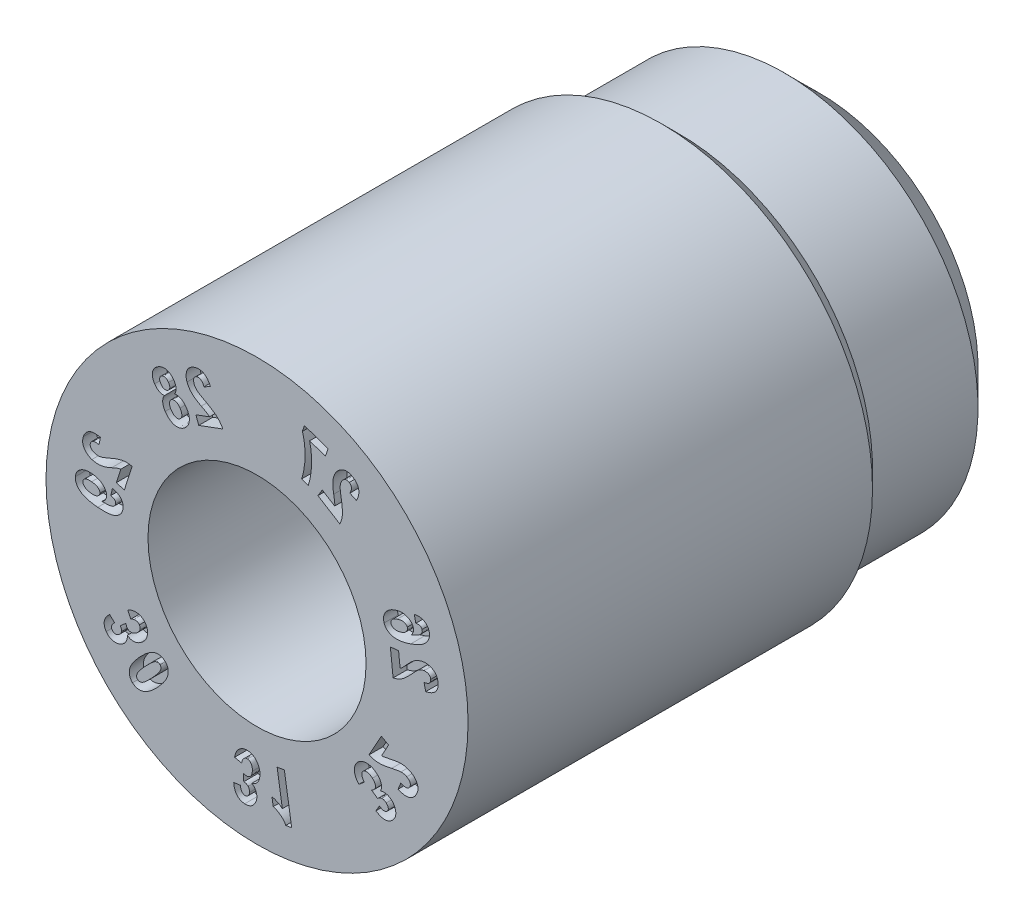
from build123d import *

# Parameters (mm, degrees)
CUT_EXTRUDE2_DEPTH = 0.2


with BuildPart() as part:
    # Sketch2 → Revolve1 (revolve)
    with BuildSketch(Plane(origin=(0, 0, 0), x_dir=(1, 0, 0), z_dir=(0, 1, 0)), mode=Mode.PRIVATE) as revolve1_sk:
        Polygon((2.249621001, 7.999984), (0.8, 7.999984), (0.8, 5.499984), (1.55, 5.499984), (1.55, 0), (3, 0), (3, 5.749984), (2.75, 5.999984), (2.75, 7.499605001), align=None)
    revolve(revolve1_sk.sketch.rotate(Axis((0, 0, -4.849143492), (0, 0, 1)), 180), axis=Axis((0, 0, -4.849143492), (0, 0, 1)))

    # Sketch8 → Cut-Extrude2 (cut)
    # profile 1 of 14: a face of its own
    with BuildSketch(Plane.XY):
        with BuildLine():
            Line((2.012147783, 0.393334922), (1.895227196, 0.380620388))
            Line((1.895227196, 0.380620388), (1.934583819, 0.018743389))
            add(Edge.make_bspline(
                [(1.934583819, 0.018743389), (1.94540127, 0.021160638), (1.966981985, 0.025983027), (1.998152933, 0.037216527), (2.028300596, 0.050939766), (2.052562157, 0.065038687), (2.071942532, 0.078464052), (2.087650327, 0.09028007), (2.104151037, 0.104160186), (2.121741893, 0.119805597), (2.140104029, 0.137561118), (2.159770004, 0.156853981), (2.180120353, 0.17833475), (2.193925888, 0.193346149), (2.201068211, 0.201112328)],
                knots=[0, 0, 0, 0, 1.210903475, 2.415741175, 3.614422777, 4.829304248, 5.477408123, 6.191639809, 6.977581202, 7.834306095, 8.765204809, 9.770030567, 10.846320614, 12, 12, 12, 12], degree=3))
            add(Edge.make_bspline(
                [(2.201068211, 0.201112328), (2.206664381, 0.207205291), (2.217344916, 0.218833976), (2.232806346, 0.235247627), (2.24678372, 0.24991469), (2.259626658, 0.262554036), (2.270733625, 0.273682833), (2.280583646, 0.282909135), (2.289033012, 0.290324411), (2.294424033, 0.294423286), (2.296824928, 0.296248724)],
                knots=[0, 0, 0, 0, 1.469359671, 2.804336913, 4.005076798, 5.067497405, 6.004650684, 6.797449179, 7.46444311, 8, 8, 8, 8], degree=3))
            add(Edge.make_bspline(
                [(2.296824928, 0.296248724), (2.302990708, 0.300542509), (2.315011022, 0.308913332), (2.334444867, 0.318371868), (2.354196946, 0.325119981), (2.36771221, 0.327230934), (2.374387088, 0.328273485)],
                knots=[0, 0, 0, 0, 1.061115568, 2.068666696, 3.046158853, 4, 4, 4, 4], degree=3))
            add(Edge.make_bspline(
                [(2.374387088, 0.328273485), (2.381164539, 0.328845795), (2.393945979, 0.329925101), (2.41212656, 0.328088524), (2.428055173, 0.323811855), (2.441525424, 0.316575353), (2.452524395, 0.307136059), (2.460822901, 0.295615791), (2.466617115, 0.282363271), (2.46812173, 0.272717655), (2.468895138, 0.267759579)],
                knots=[0, 0, 0, 0, 1.284830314, 2.42303217, 3.43989917, 4.386563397, 5.292301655, 6.158766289, 7.053562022, 8, 8, 8, 8], degree=3))
            add(Edge.make_bspline(
                [(2.468895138, 0.267759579), (2.469200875, 0.26232226), (2.469788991, 0.251863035), (2.466524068, 0.236662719), (2.459466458, 0.223250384), (2.449107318, 0.211471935), (2.435204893, 0.201551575), (2.417901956, 0.193617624), (2.397390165, 0.186852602), (2.382364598, 0.184096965), (2.374363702, 0.182629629)],
                knots=[0, 0, 0, 0, 0.913722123, 1.757635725, 2.579276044, 3.438933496, 4.37433614, 5.431505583, 6.632314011, 8, 8, 8, 8], degree=3))
            Line((2.374363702, 0.182629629), (2.398120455, 0.081579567))
            add(Edge.make_bspline(
                [(2.398120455, 0.081579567), (2.406102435, 0.083329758), (2.42160439, 0.086728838), (2.443826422, 0.093227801), (2.464206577, 0.10089892), (2.482883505, 0.109304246), (2.499707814, 0.118786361), (2.514772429, 0.129186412), (2.528021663, 0.140657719), (2.539488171, 0.153090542), (2.549220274, 0.166435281), (2.557472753, 0.180528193), (2.564101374, 0.19545438), (2.56897026, 0.211228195), (2.572586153, 0.227704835), (2.574339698, 0.245032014), (2.574470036, 0.263166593), (2.573444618, 0.275448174), (2.572918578, 0.281748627)],
                knots=[0, 0, 0, 0, 1.316678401, 2.557146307, 3.727226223, 4.823655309, 5.854584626, 6.835260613, 7.768888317, 8.673026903, 9.554907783, 10.425565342, 11.300463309, 12.180346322, 13.081818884, 14.014614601, 14.981496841, 16, 16, 16, 16], degree=3))
            add(Edge.make_bspline(
                [(2.572918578, 0.281748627), (2.571992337, 0.288578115), (2.570195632, 0.301825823), (2.565644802, 0.320913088), (2.559304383, 0.338397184), (2.551548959, 0.354546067), (2.54198972, 0.369031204), (2.530972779, 0.382206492), (2.518176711, 0.393681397), (2.504041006, 0.403646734), (2.489019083, 0.412222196), (2.473459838, 0.419337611), (2.457554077, 0.425080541), (2.441336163, 0.429528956), (2.424733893, 0.432401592), (2.407795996, 0.434108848), (2.390493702, 0.434294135), (2.378896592, 0.433268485), (2.373051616, 0.432751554)],
                knots=[0, 0, 0, 0, 1.173652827, 2.276629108, 3.335023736, 4.336619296, 5.321091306, 6.283820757, 7.254537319, 8.239831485, 9.225125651, 10.197062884, 11.150738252, 12.103199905, 13.057936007, 14.017536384, 15.000832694, 16, 16, 16, 16], degree=3))
            add(Edge.make_bspline(
                [(2.373051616, 0.432751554), (2.366388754, 0.431895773), (2.353125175, 0.430192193), (2.333644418, 0.425796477), (2.314578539, 0.420232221), (2.29590054, 0.413415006), (2.277550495, 0.40503767), (2.259369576, 0.395251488), (2.241261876, 0.383948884), (2.226235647, 0.373348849), (2.213984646, 0.363795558), (2.204275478, 0.355377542), (2.193931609, 0.346030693), (2.183050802, 0.335614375), (2.171517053, 0.324356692), (2.159568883, 0.311877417), (2.146945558, 0.298487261), (2.138439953, 0.289097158), (2.134074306, 0.284277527)],
                knots=[0, 0, 0, 0, 1.116805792, 2.223195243, 3.31725657, 4.418851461, 5.527133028, 6.669491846, 7.850789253, 9.075422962, 9.72636706, 10.433968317, 11.212223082, 12.045064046, 12.93920453, 13.892729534, 14.918407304, 16, 16, 16, 16], degree=3))
            add(Edge.make_bspline(
                [(2.134074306, 0.284277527), (2.130030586, 0.279817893), (2.122326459, 0.271321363), (2.111292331, 0.259257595), (2.101183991, 0.24860097), (2.092495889, 0.238872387), (2.084464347, 0.230806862), (2.077826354, 0.223720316), (2.072046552, 0.218112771), (2.063443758, 0.209806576), (2.051444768, 0.199349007), (2.03992651, 0.191869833), (2.034393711, 0.188277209)],
                knots=[0, 0, 0, 0, 1.30077431, 2.478245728, 3.532467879, 4.474445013, 5.295791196, 5.991390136, 6.572169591, 7.035389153, 8.575948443, 10, 10, 10, 10], degree=3))
            Line((2.034393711, 0.188277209), (2.012147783, 0.393334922))
        make_face()
    # profile 2 of 14: a face of its own
    with BuildSketch(Plane.XY):
        with BuildLine():
            Line((2.236954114, 0.952024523), (2.256685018, 0.85237774))
            add(Edge.make_bspline(
                [(2.256685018, 0.85237774), (2.262431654, 0.853598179), (2.273257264, 0.855897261), (2.288897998, 0.857157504), (2.302807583, 0.856434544), (2.31506442, 0.853527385), (2.325672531, 0.848484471), (2.334473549, 0.841175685), (2.341488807, 0.831713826), (2.344402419, 0.824306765), (2.345921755, 0.820444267)],
                knots=[0, 0, 0, 0, 1.333591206, 2.512241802, 3.554141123, 4.485525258, 5.356408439, 6.197977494, 7.060314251, 8, 8, 8, 8], degree=3))
            add(Edge.make_bspline(
                [(2.345921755, 0.820444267), (2.34672688, 0.81779671), (2.348326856, 0.812535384), (2.349109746, 0.80437873), (2.348925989, 0.796219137), (2.347364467, 0.788017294), (2.344590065, 0.779808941), (2.340619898, 0.77156471), (2.335409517, 0.763374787), (2.329074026, 0.754881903), (2.320686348, 0.746392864), (2.310029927, 0.737745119), (2.297060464, 0.728768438), (2.281697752, 0.719467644), (2.263967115, 0.709940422), (2.243710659, 0.700355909), (2.221259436, 0.690093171), (2.205297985, 0.683573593), (2.196945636, 0.680162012)],
                knots=[0, 0, 0, 0, 0.592511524, 1.177461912, 1.749080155, 2.339419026, 2.961182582, 3.603851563, 4.297947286, 5.041581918, 5.873473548, 6.851091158, 7.983032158, 9.255776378, 10.703201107, 12.300391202, 14.064059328, 16, 16, 16, 16], degree=3))
            add(Edge.make_bspline(
                [(2.196945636, 0.680162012), (2.200079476, 0.684690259), (2.206149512, 0.693461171), (2.213764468, 0.707112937), (2.219144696, 0.720901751), (2.223017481, 0.734583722), (2.2248197, 0.748302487), (2.224767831, 0.762024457), (2.223081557, 0.775834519), (2.220288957, 0.784751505), (2.218874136, 0.789269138)],
                knots=[0, 0, 0, 0, 1.13820707, 2.204630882, 3.222381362, 4.191430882, 5.13771163, 6.07180751, 7.023115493, 8, 8, 8, 8], degree=3))
            add(Edge.make_bspline(
                [(2.218874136, 0.789269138), (2.21699436, 0.794157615), (2.213265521, 0.803854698), (2.20557154, 0.817335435), (2.196455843, 0.82984325), (2.185589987, 0.841109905), (2.17313878, 0.85132009), (2.159207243, 0.860559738), (2.143544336, 0.868470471), (2.126572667, 0.875342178), (2.108478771, 0.88093897), (2.089438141, 0.884485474), (2.069809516, 0.88637527), (2.049471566, 0.886527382), (2.02850899, 0.884718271), (2.006873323, 0.881140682), (1.984540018, 0.875984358), (1.969690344, 0.871114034), (1.96207588, 0.86861668)],
                knots=[0, 0, 0, 0, 0.841497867, 1.669246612, 2.48822592, 3.325730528, 4.179458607, 5.074245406, 6.00919843, 6.997071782, 8.017255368, 9.050224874, 10.106912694, 11.185890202, 12.317296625, 13.487094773, 14.711458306, 16, 16, 16, 16], degree=3))
            add(Edge.make_bspline(
                [(1.96207588, 0.86861668), (1.954085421, 0.865709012), (1.938543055, 0.860053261), (1.916441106, 0.850083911), (1.89623001, 0.839022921), (1.877887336, 0.826843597), (1.86136245, 0.813707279), (1.846576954, 0.7995904), (1.833730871, 0.78431169), (1.822777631, 0.768171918), (1.813637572, 0.751536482), (1.806822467, 0.734548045), (1.801544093, 0.717594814), (1.798590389, 0.700466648), (1.797511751, 0.683195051), (1.798715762, 0.665897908), (1.801454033, 0.648391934), (1.805068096, 0.637053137), (1.806908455, 0.631279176)],
                knots=[0, 0, 0, 0, 1.28476095, 2.499008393, 3.660368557, 4.763100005, 5.822459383, 6.846954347, 7.847372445, 8.833122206, 9.790834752, 10.709710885, 11.595209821, 12.469325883, 13.329980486, 14.203914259, 15.085394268, 16, 16, 16, 16], degree=3))
            add(Edge.make_bspline(
                [(1.806908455, 0.631279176), (1.809240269, 0.625062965), (1.813839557, 0.612802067), (1.823697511, 0.595924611), (1.835400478, 0.58056761), (1.849158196, 0.566845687), (1.864880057, 0.554793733), (1.882622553, 0.544396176), (1.902383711, 0.535697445), (1.92417953, 0.528483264), (1.948261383, 0.523456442), (1.974779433, 0.52110752), (2.003708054, 0.521430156), (2.035052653, 0.524292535), (2.068834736, 0.529634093), (2.105018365, 0.537906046), (2.143762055, 0.54839705), (2.170119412, 0.557190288), (2.183773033, 0.561745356)],
                knots=[0, 0, 0, 0, 0.744199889, 1.467865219, 2.184572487, 2.90691764, 3.642357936, 4.402718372, 5.209916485, 6.062013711, 6.975828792, 7.965088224, 9.04468978, 10.219402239, 11.495773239, 12.881284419, 14.384445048, 16, 16, 16, 16], degree=3))
            add(Edge.make_bspline(
                [(2.183773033, 0.561745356), (2.19756066, 0.566634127), (2.22417038, 0.576069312), (2.261840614, 0.591780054), (2.295992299, 0.607968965), (2.326581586, 0.624796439), (2.35356201, 0.642308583), (2.377167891, 0.660215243), (2.397077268, 0.678968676), (2.413369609, 0.69844449), (2.426485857, 0.718252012), (2.437099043, 0.738067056), (2.444665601, 0.758178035), (2.449791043, 0.778319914), (2.452152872, 0.798631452), (2.451811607, 0.819107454), (2.448833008, 0.839742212), (2.444702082, 0.85314118), (2.442611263, 0.859922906)],
                knots=[0, 0, 0, 0, 1.589652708, 3.067983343, 4.433649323, 5.695604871, 6.859266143, 7.92669892, 8.911578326, 9.825182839, 10.67979538, 11.489716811, 12.262756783, 13.009163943, 13.743392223, 14.477973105, 15.229644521, 16, 16, 16, 16], degree=3))
            add(Edge.make_bspline(
                [(2.442611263, 0.859922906), (2.440912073, 0.864508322), (2.437550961, 0.873578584), (2.431145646, 0.886386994), (2.423668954, 0.898189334), (2.415260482, 0.909106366), (2.405693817, 0.918940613), (2.395193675, 0.92791202), (2.383588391, 0.93572751), (2.371075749, 0.942682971), (2.357573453, 0.94853743), (2.343026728, 0.952869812), (2.327617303, 0.956027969), (2.311289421, 0.958008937), (2.293992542, 0.958469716), (2.275783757, 0.957686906), (2.256613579, 0.955588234), (2.243637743, 0.953236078), (2.236954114, 0.952024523)],
                knots=[0, 0, 0, 0, 0.942137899, 1.863612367, 2.754149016, 3.631912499, 4.514765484, 5.394088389, 6.289435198, 7.20696329, 8.150632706, 9.120005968, 10.12714648, 11.179873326, 12.28611005, 13.458547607, 14.690941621, 16, 16, 16, 16], degree=3))
        make_face()
        with BuildLine():
            add(Edge.make_bspline(
                [(2.051567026, 0.639838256), (2.046747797, 0.638210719), (2.037399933, 0.635053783), (2.023442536, 0.631654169), (2.010204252, 0.628922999), (1.997556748, 0.627264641), (1.98553758, 0.626501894), (1.974183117, 0.626930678), (1.963422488, 0.628062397), (1.95342372, 0.630475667), (1.944096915, 0.633337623), (1.935820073, 0.637156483), (1.928261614, 0.64118361), (1.921712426, 0.645914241), (1.916095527, 0.651181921), (1.911221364, 0.656869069), (1.90747355, 0.663276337), (1.905661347, 0.667857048), (1.904760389, 0.670134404)],
                knots=[0, 0, 0, 0, 1.475949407, 2.862900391, 4.166964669, 5.398359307, 6.563092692, 7.658261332, 8.693837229, 9.69779003, 10.63959194, 11.520864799, 12.339392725, 13.122689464, 13.857756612, 14.57102195, 15.289566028, 16, 16, 16, 16], degree=3))
            add(Edge.make_bspline(
                [(1.904760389, 0.670134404), (1.903493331, 0.674645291), (1.90099447, 0.683541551), (1.902157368, 0.697679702), (1.906701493, 0.711605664), (1.913494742, 0.72271389), (1.920671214, 0.731456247), (1.927561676, 0.737908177), (1.935687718, 0.744176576), (1.945013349, 0.750199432), (1.955588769, 0.755975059), (1.967359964, 0.761473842), (1.980309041, 0.767019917), (1.989506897, 0.770219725), (1.994295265, 0.771885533)],
                knots=[0, 0, 0, 0, 1.107892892, 2.184958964, 3.317218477, 4.572769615, 5.258842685, 6.006704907, 6.81463998, 7.70012255, 8.647391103, 9.681690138, 10.793096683, 12, 12, 12, 12], degree=3))
            add(Edge.make_bspline(
                [(1.994295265, 0.771885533), (1.999254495, 0.773534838), (2.008848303, 0.776725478), (2.022961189, 0.780566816), (2.036270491, 0.783502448), (2.048776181, 0.785140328), (2.060411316, 0.786367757), (2.071243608, 0.786201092), (2.081288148, 0.785202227), (2.093187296, 0.782555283), (2.106377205, 0.777670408), (2.119549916, 0.76893082), (2.129788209, 0.757714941), (2.133653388, 0.748648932), (2.135594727, 0.744095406)],
                knots=[0, 0, 0, 0, 1.174194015, 2.271520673, 3.285528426, 4.233681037, 5.10465996, 5.911519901, 6.663571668, 7.368730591, 8.647029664, 9.79859306, 10.894313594, 12, 12, 12, 12], degree=3))
            add(Edge.make_bspline(
                [(2.135594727, 0.744095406), (2.136800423, 0.739396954), (2.139191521, 0.730079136), (2.138483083, 0.715237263), (2.133413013, 0.700700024), (2.126684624, 0.688889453), (2.119411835, 0.679770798), (2.112881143, 0.672904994), (2.105026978, 0.666706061), (2.096518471, 0.660413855), (2.08669062, 0.654861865), (2.075983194, 0.649384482), (2.064186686, 0.644291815), (2.055854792, 0.641351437), (2.051567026, 0.639838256)],
                knots=[0, 0, 0, 0, 1.167663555, 2.315672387, 3.527606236, 4.857989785, 5.58021247, 6.343114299, 7.141796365, 7.99474654, 8.898068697, 9.865059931, 10.901315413, 12, 12, 12, 12], degree=3))
        make_face(mode=Mode.SUBTRACT)
    # profile 3 of 14: a face of its own
    with BuildSketch(Plane.XY):
        with BuildLine():
            Line((0.927892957, 1.828795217), (0.865636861, 1.728335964))
            Line((0.865636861, 1.728335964), (1.176881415, 1.53555217))
            add(Edge.make_bspline(
                [(1.176881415, 1.53555217), (1.181641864, 1.545657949), (1.191100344, 1.565737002), (1.20170019, 1.59733019), (1.209257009, 1.629726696), (1.213183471, 1.657645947), (1.21480779, 1.681296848), (1.214872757, 1.701069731), (1.214118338, 1.722764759), (1.212521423, 1.746374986), (1.210154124, 1.77195242), (1.20672347, 1.799464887), (1.202608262, 1.82894511), (1.199201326, 1.849190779), (1.197441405, 1.859649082)],
                knots=[0, 0, 0, 0, 1.213791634, 2.41166839, 3.614883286, 4.826605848, 5.472644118, 6.191183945, 6.975341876, 7.832633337, 8.763817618, 9.767857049, 10.846942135, 12, 12, 12, 12], degree=3))
            add(Edge.make_bspline(
                [(1.197441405, 1.859649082), (1.196098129, 1.867856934), (1.193537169, 1.883505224), (1.189995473, 1.90586056), (1.187233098, 1.926030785), (1.184793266, 1.943968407), (1.183137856, 1.959717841), (1.181891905, 1.97321175), (1.181348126, 1.98450699), (1.18137385, 1.991300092), (1.181385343, 1.994335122)],
                knots=[0, 0, 0, 0, 1.47009808, 2.802745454, 4.00049633, 5.068537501, 6.002265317, 6.799400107, 7.463594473, 8, 8, 8, 8], degree=3))
            add(Edge.make_bspline(
                [(1.181385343, 1.994335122), (1.181777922, 2.00188581), (1.182545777, 2.016654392), (1.187148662, 2.037909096), (1.193840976, 2.057819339), (1.200596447, 2.069761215), (1.203940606, 2.075672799)],
                knots=[0, 0, 0, 0, 1.061112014, 2.075455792, 3.047293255, 4, 4, 4, 4], degree=3))
            add(Edge.make_bspline(
                [(1.203940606, 2.075672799), (1.207665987, 2.08139441), (1.214711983, 2.092215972), (1.227486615, 2.105410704), (1.240658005, 2.115569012), (1.254796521, 2.121565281), (1.269069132, 2.124481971), (1.283324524, 2.12411296), (1.297371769, 2.120279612), (1.30593105, 2.115562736), (1.310352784, 2.113125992)],
                knots=[0, 0, 0, 0, 1.282396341, 2.425458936, 3.44098324, 4.391968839, 5.288991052, 6.164980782, 7.052026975, 8, 8, 8, 8], degree=3))
            add(Edge.make_bspline(
                [(1.310352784, 2.113125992), (1.314862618, 2.109996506), (1.323532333, 2.103980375), (1.333547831, 2.091963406), (1.339915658, 2.078139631), (1.342727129, 2.062592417), (1.341947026, 2.045467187), (1.337652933, 2.02676509), (1.330161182, 2.006421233), (1.323024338, 1.992844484), (1.319240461, 1.98564624)],
                knots=[0, 0, 0, 0, 0.915994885, 1.760910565, 2.583475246, 3.437762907, 4.380957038, 5.433962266, 6.639514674, 8, 8, 8, 8], degree=3))
            Line((1.319240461, 1.98564624), (1.414177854, 1.941732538))
            add(Edge.make_bspline(
                [(1.414177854, 1.941732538), (1.417765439, 1.949140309), (1.424729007, 1.963518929), (1.432996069, 1.985286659), (1.439804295, 2.006053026), (1.444742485, 2.026044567), (1.447399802, 2.045267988), (1.448638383, 2.063662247), (1.447706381, 2.081286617), (1.444931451, 2.098078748), (1.440422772, 2.11409769), (1.434384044, 2.129396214), (1.426544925, 2.143857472), (1.417155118, 2.157580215), (1.40618442, 2.170561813), (1.393627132, 2.182816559), (1.379406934, 2.194212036), (1.369023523, 2.20094566), (1.363720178, 2.20438487)],
                knots=[0, 0, 0, 0, 1.31786417, 2.55799868, 3.726190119, 4.817613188, 5.851082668, 6.831217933, 7.766471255, 8.671320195, 9.55211188, 10.4274872, 11.300405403, 12.181284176, 13.086669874, 14.018471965, 14.987931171, 16, 16, 16, 16], degree=3))
            add(Edge.make_bspline(
                [(1.363720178, 2.20438487), (1.357756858, 2.207879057), (1.346124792, 2.214694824), (1.328200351, 2.222903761), (1.310341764, 2.228647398), (1.292762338, 2.232508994), (1.275317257, 2.233820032), (1.258065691, 2.233463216), (1.241090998, 2.2302558), (1.224458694, 2.225276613), (1.208440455, 2.218586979), (1.193166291, 2.210684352), (1.178688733, 2.201743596), (1.165134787, 2.191550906), (1.152536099, 2.180182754), (1.140788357, 2.167695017), (1.129893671, 2.154126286), (1.123483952, 2.144320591), (1.120255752, 2.139382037)],
                knots=[0, 0, 0, 0, 1.170055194, 2.282312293, 3.330140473, 4.342005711, 5.322195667, 6.286365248, 7.255265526, 8.237145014, 9.222307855, 10.190116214, 11.146996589, 12.100436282, 13.057913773, 14.01709101, 15.001325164, 16, 16, 16, 16], degree=3))
            add(Edge.make_bspline(
                [(1.120255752, 2.139382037), (1.116788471, 2.133574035), (1.109895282, 2.122027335), (1.10132761, 2.103840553), (1.093791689, 2.085352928), (1.087870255, 2.066243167), (1.082998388, 2.046574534), (1.079586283, 2.026072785), (1.077335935, 2.004718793), (1.076406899, 1.986236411), (1.076418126, 1.970586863), (1.077044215, 1.957684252), (1.078045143, 1.943706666), (1.079350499, 1.928636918), (1.081244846, 1.912516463), (1.083708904, 1.895311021), (1.086486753, 1.877022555), (1.088680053, 1.864503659), (1.089806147, 1.858076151)],
                knots=[0, 0, 0, 0, 1.118093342, 2.222845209, 3.321014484, 4.417594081, 5.528398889, 6.669989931, 7.851820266, 9.07813363, 9.728628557, 10.439317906, 11.214013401, 12.046278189, 12.940768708, 13.898053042, 14.920808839, 16, 16, 16, 16], degree=3))
            add(Edge.make_bspline(
                [(1.089806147, 1.858076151), (1.090897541, 1.852128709), (1.092975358, 1.840805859), (1.095494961, 1.82454441), (1.098122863, 1.810007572), (1.099945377, 1.796986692), (1.101768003, 1.785683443), (1.1031857, 1.775985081), (1.103997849, 1.767918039), (1.10526207, 1.755933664), (1.105988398, 1.739921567), (1.104884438, 1.726123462), (1.104354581, 1.719500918)],
                knots=[0, 0, 0, 0, 1.297620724, 2.470434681, 3.531265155, 4.467489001, 5.29165864, 5.988491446, 6.570479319, 7.031353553, 8.575167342, 10, 10, 10, 10], degree=3))
            Line((1.104354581, 1.719500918), (0.927892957, 1.828795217))
        make_face()
    # profile 4 of 14: a face of its own
    with BuildSketch(Plane.XY):
        with BuildLine():
            Line((0.971884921, 2.267442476), (1.010227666, 2.378996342))
            Line((1.010227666, 2.378996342), (0.673632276, 2.495031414))
            Line((0.673632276, 2.495031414), (0.643700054, 2.407861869))
            add(Edge.make_bspline(
                [(0.643700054, 2.407861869), (0.645694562, 2.402326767), (0.649818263, 2.390882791), (0.655155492, 2.372795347), (0.660194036, 2.353396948), (0.664613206, 2.332631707), (0.668823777, 2.310593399), (0.672596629, 2.28722387), (0.675815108, 2.262484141), (0.679651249, 2.227664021), (0.682972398, 2.182854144), (0.683917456, 2.128189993), (0.681729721, 2.072740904), (0.67765519, 2.026242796), (0.672972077, 1.989257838), (0.669011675, 1.962206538), (0.664437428, 1.936029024), (0.659390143, 1.910704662), (0.653867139, 1.886227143), (0.647732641, 1.862633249), (0.641185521, 1.839822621), (0.636232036, 1.825039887), (0.633786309, 1.817741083)],
                knots=[0, 0, 0, 0, 0.588831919, 1.217426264, 1.886882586, 2.594662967, 3.342116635, 4.132729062, 4.963842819, 5.839192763, 7.639211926, 9.459420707, 11.308847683, 13.191636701, 14.129702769, 15.040396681, 15.928115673, 16.789483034, 17.625054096, 18.43952994, 19.229535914, 20, 20, 20, 20], degree=3))
            Line((0.633786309, 1.817741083), (0.728532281, 1.785097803))
            add(Edge.make_bspline(
                [(0.728532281, 1.785097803), (0.731948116, 1.796355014), (0.738783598, 1.818881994), (0.747781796, 1.853071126), (0.755243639, 1.887742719), (0.761830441, 1.922706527), (0.767273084, 1.958080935), (0.771262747, 1.99385107), (0.774295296, 2.030020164), (0.776084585, 2.066440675), (0.776580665, 2.102811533), (0.776157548, 2.138820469), (0.77424862, 2.174330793), (0.771556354, 2.20937269), (0.767500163, 2.243920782), (0.762042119, 2.277929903), (0.755884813, 2.311539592), (0.750592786, 2.333609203), (0.747956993, 2.344601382)],
                knots=[0, 0, 0, 0, 0.996518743, 1.994149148, 2.993784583, 4.000235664, 5.007822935, 6.024854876, 7.048579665, 8.082148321, 9.113091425, 10.129560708, 11.132103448, 12.125020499, 13.106434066, 14.077769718, 15.042597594, 16, 16, 16, 16], degree=3))
            Line((0.747956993, 2.344601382), (0.971884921, 2.267442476))
        make_face()
    # profile 5 of 14: a face of its own
    with BuildSketch(Plane.XY):
        with BuildLine():
            Line((-0.869205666, 1.856581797), (-0.828454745, 1.746287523))
            Line((-0.828454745, 1.746287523), (-0.487103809, 1.872365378))
            add(Edge.make_bspline(
                [(-0.487103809, 1.872365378), (-0.492094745, 1.88225344), (-0.502036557, 1.901950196), (-0.52026244, 1.929599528), (-0.541079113, 1.95532629), (-0.560457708, 1.97557061), (-0.578033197, 1.991256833), (-0.593485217, 2.00341338), (-0.610863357, 2.016217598), (-0.630480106, 2.029304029), (-0.652013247, 2.043060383), (-0.675615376, 2.057244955), (-0.70123, 2.071973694), (-0.719135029, 2.081685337), (-0.728413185, 2.086717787)],
                knots=[0, 0, 0, 0, 1.210854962, 2.411990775, 3.61380145, 4.827105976, 5.47284646, 6.189231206, 6.976933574, 7.833555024, 8.768129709, 9.771909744, 10.845432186, 12, 12, 12, 12], degree=3))
            add(Edge.make_bspline(
                [(-0.728413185, 2.086717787), (-0.735671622, 2.090673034), (-0.749541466, 2.098230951), (-0.769257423, 2.109138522), (-0.786830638, 2.119231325), (-0.802385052, 2.128269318), (-0.815739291, 2.136582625), (-0.827113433, 2.143789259), (-0.836341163, 2.150191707), (-0.841655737, 2.154350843), (-0.844028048, 2.156207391)],
                knots=[0, 0, 0, 0, 1.469278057, 2.807582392, 4.004834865, 5.071359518, 6.004871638, 6.800639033, 7.464631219, 8, 8, 8, 8], degree=3))
            add(Edge.make_bspline(
                [(-0.844028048, 2.156207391), (-0.849690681, 2.161155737), (-0.860773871, 2.170840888), (-0.874584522, 2.187467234), (-0.886082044, 2.204936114), (-0.891341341, 2.21754287), (-0.893957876, 2.223814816)],
                knots=[0, 0, 0, 0, 1.060218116, 2.075112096, 3.042355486, 4, 4, 4, 4], degree=3))
            add(Edge.make_bspline(
                [(-0.893957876, 2.223814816), (-0.896095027, 2.230252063), (-0.900134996, 2.242420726), (-0.903111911, 2.260499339), (-0.902553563, 2.277027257), (-0.898955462, 2.291848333), (-0.892458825, 2.304799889), (-0.883304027, 2.315605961), (-0.871788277, 2.324414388), (-0.862809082, 2.328244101), (-0.858162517, 2.330225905)],
                knots=[0, 0, 0, 0, 1.281795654, 2.42304472, 3.444932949, 4.389250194, 5.286285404, 6.159474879, 7.04756268, 8, 8, 8, 8], degree=3))
            add(Edge.make_bspline(
                [(-0.858162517, 2.330225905), (-0.852944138, 2.331872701), (-0.842953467, 2.33502552), (-0.827428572, 2.335461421), (-0.812684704, 2.332038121), (-0.798818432, 2.324646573), (-0.785815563, 2.313633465), (-0.773876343, 2.298809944), (-0.762560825, 2.280455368), (-0.756214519, 2.266569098), (-0.752836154, 2.259176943)],
                knots=[0, 0, 0, 0, 0.917995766, 1.757518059, 2.580035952, 3.440045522, 4.37817056, 5.430832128, 6.632340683, 8, 8, 8, 8], degree=3))
            Line((-0.752836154, 2.259176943), (-0.66043747, 2.306666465))
            add(Edge.make_bspline(
                [(-0.66043747, 2.306666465), (-0.664079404, 2.313976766), (-0.671158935, 2.328187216), (-0.682932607, 2.348081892), (-0.694965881, 2.366201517), (-0.707933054, 2.382051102), (-0.721059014, 2.396254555), (-0.7349162, 2.408306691), (-0.749162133, 2.418515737), (-0.76405514, 2.42658019), (-0.779402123, 2.432718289), (-0.795087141, 2.437223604), (-0.81119942, 2.440062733), (-0.827682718, 2.441037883), (-0.844604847, 2.440347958), (-0.861855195, 2.437905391), (-0.879490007, 2.433631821), (-0.891132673, 2.429670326), (-0.897084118, 2.427645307)],
                knots=[0, 0, 0, 0, 1.315340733, 2.556882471, 3.722018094, 4.815589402, 5.852468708, 6.833993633, 7.768961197, 8.670525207, 9.555177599, 10.426871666, 11.295236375, 12.185338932, 13.08169562, 14.01942528, 14.987578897, 16, 16, 16, 16], degree=3))
            add(Edge.make_bspline(
                [(-0.897084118, 2.427645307), (-0.903488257, 2.425095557), (-0.915932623, 2.420140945), (-0.933277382, 2.411036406), (-0.948759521, 2.400683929), (-0.962505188, 2.389235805), (-0.974360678, 2.376493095), (-0.984258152, 2.362525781), (-0.992342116, 2.347425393), (-0.998631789, 2.33135687), (-1.00296425, 2.314648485), (-1.006482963, 2.297902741), (-1.00807253, 2.281075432), (-1.008522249, 2.26426726), (-1.007390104, 2.247441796), (-1.004605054, 2.230621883), (-1.000758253, 2.213719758), (-0.996909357, 2.202708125), (-0.99496577, 2.197147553)],
                knots=[0, 0, 0, 0, 1.173907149, 2.281107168, 3.330271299, 4.341955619, 5.322241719, 6.287090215, 7.250438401, 8.233906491, 9.219167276, 10.188532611, 11.146158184, 12.094311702, 13.051211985, 14.013959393, 14.997103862, 16, 16, 16, 16], degree=3))
            add(Edge.make_bspline(
                [(-0.99496577, 2.197147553), (-0.992502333, 2.19089325), (-0.987605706, 2.178461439), (-0.978800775, 2.160502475), (-0.968763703, 2.143351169), (-0.95740287, 2.126970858), (-0.94484647, 2.11121673), (-0.930889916, 2.095960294), (-0.915623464, 2.081103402), (-0.9015982, 2.069207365), (-0.889324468, 2.059698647), (-0.878881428, 2.052229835), (-0.867307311, 2.044533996), (-0.854764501, 2.036328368), (-0.840910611, 2.028070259), (-0.826005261, 2.019435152), (-0.810011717, 2.010377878), (-0.798880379, 2.004465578), (-0.793125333, 2.001408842)],
                knots=[0, 0, 0, 0, 1.118504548, 2.223275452, 3.325218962, 4.423196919, 5.538413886, 6.675910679, 7.862630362, 9.081801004, 9.734684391, 10.446554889, 11.218198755, 12.048073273, 12.94098919, 13.902189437, 14.915404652, 16, 16, 16, 16], degree=3))
            add(Edge.make_bspline(
                [(-0.793125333, 2.001408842), (-0.787808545, 1.998552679), (-0.777686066, 1.993114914), (-0.763298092, 1.985316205), (-0.750368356, 1.978303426), (-0.738979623, 1.971925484), (-0.729090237, 1.966230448), (-0.720566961, 1.961564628), (-0.713669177, 1.957383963), (-0.703603, 1.950941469), (-0.690597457, 1.941796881), (-0.680487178, 1.932520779), (-0.675631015, 1.928065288)],
                knots=[0, 0, 0, 0, 1.303090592, 2.480916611, 3.533487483, 4.478874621, 5.29907776, 5.997407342, 6.576536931, 7.040000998, 8.578255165, 10, 10, 10, 10], degree=3))
            Line((-0.675631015, 1.928065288), (-0.869205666, 1.856581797))
        make_face()
    # profile 6 of 14: a face of its own
    with BuildSketch(Plane.XY):
        with BuildLine():
            add(Edge.make_bspline(
                [(-1.170314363, 1.96392839), (-1.167042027, 1.970194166), (-1.1606264, 1.98247863), (-1.154413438, 2.002024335), (-1.150810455, 2.021684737), (-1.150603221, 2.04159514), (-1.153375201, 2.061650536), (-1.159227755, 2.081760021), (-1.167991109, 2.102060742), (-1.175855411, 2.11496719), (-1.17993445, 2.121661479)],
                knots=[0, 0, 0, 0, 1.013706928, 1.987438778, 2.933061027, 3.875285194, 4.834400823, 5.831171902, 6.875076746, 8, 8, 8, 8], degree=3))
            add(Edge.make_bspline(
                [(-1.17993445, 2.121661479), (-1.183504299, 2.126988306), (-1.190455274, 2.137360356), (-1.202244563, 2.151384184), (-1.214447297, 2.16396544), (-1.227225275, 2.175068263), (-1.240858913, 2.184341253), (-1.254985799, 2.19218937), (-1.269792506, 2.198370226), (-1.285143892, 2.202809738), (-1.300776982, 2.205829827), (-1.316584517, 2.206715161), (-1.332403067, 2.206193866), (-1.348212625, 2.203587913), (-1.364088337, 2.19948739), (-1.379938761, 2.193598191), (-1.39577518, 2.185915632), (-1.405943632, 2.179628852), (-1.411150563, 2.176409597)],
                knots=[0, 0, 0, 0, 1.145605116, 2.23064728, 3.269536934, 4.277052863, 5.250715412, 6.211735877, 7.161757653, 8.112114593, 9.064480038, 10.001370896, 10.936492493, 11.88835621, 12.859300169, 13.863872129, 14.906158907, 16, 16, 16, 16], degree=3))
            add(Edge.make_bspline(
                [(-1.411150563, 2.176409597), (-1.416505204, 2.172809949), (-1.426951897, 2.165787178), (-1.440880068, 2.153737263), (-1.453227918, 2.14129921), (-1.463551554, 2.128028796), (-1.472177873, 2.114179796), (-1.478851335, 2.099608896), (-1.483547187, 2.084330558), (-1.486471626, 2.068584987), (-1.48772039, 2.05257189), (-1.487484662, 2.036590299), (-1.48591305, 2.020748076), (-1.482903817, 2.005071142), (-1.478275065, 1.989588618), (-1.472142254, 1.974273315), (-1.464774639, 1.958956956), (-1.458696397, 1.949214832), (-1.455606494, 1.944262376)],
                knots=[0, 0, 0, 0, 1.160666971, 2.264415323, 3.309599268, 4.311612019, 5.284676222, 6.241200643, 7.188324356, 8.155294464, 9.118784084, 10.075376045, 11.02946587, 11.981623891, 12.944979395, 13.933980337, 14.949728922, 16, 16, 16, 16], degree=3))
            add(Edge.make_bspline(
                [(-1.455606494, 1.944262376), (-1.451178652, 1.937778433), (-1.442559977, 1.92515761), (-1.427214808, 1.908850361), (-1.410890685, 1.894981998), (-1.393192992, 1.884205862), (-1.374799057, 1.876149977), (-1.355920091, 1.870576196), (-1.336550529, 1.868076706), (-1.323570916, 1.868609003), (-1.317076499, 1.868875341)],
                knots=[0, 0, 0, 0, 1.133910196, 2.20712593, 3.226953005, 4.22312822, 5.19155338, 6.123750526, 7.061208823, 8, 8, 8, 8], degree=3))
            add(Edge.make_bspline(
                [(-1.317076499, 1.868875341), (-1.321187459, 1.861525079), (-1.329221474, 1.847160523), (-1.337022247, 1.824104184), (-1.34122491, 1.800804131), (-1.341728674, 1.777123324), (-1.338280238, 1.753102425), (-1.331100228, 1.728766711), (-1.320337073, 1.703977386), (-1.310604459, 1.688140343), (-1.30555894, 1.679930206)],
                knots=[0, 0, 0, 0, 1.004730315, 1.963536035, 2.892609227, 3.825046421, 4.781355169, 5.780759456, 6.849515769, 8, 8, 8, 8], degree=3))
            add(Edge.make_bspline(
                [(-1.30555894, 1.679930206), (-1.299884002, 1.671658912), (-1.288857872, 1.655588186), (-1.269753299, 1.634185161), (-1.249292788, 1.615870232), (-1.227553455, 1.600694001), (-1.204994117, 1.588709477), (-1.181787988, 1.58045), (-1.158267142, 1.575447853), (-1.134555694, 1.57436794), (-1.111070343, 1.576484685), (-1.088126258, 1.582012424), (-1.065788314, 1.590776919), (-1.051907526, 1.599015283), (-1.044849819, 1.603204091)],
                knots=[0, 0, 0, 0, 1.183727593, 2.299925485, 3.378775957, 4.420074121, 5.423841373, 6.386267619, 7.32015173, 8.253261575, 9.178653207, 10.096125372, 11.031972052, 12, 12, 12, 12], degree=3))
            add(Edge.make_bspline(
                [(-1.044849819, 1.603204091), (-1.039523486, 1.606870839), (-1.029077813, 1.614061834), (-1.014942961, 1.626347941), (-1.002346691, 1.639507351), (-0.991408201, 1.653698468), (-0.98231992, 1.668982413), (-0.974591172, 1.685044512), (-0.968791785, 1.702213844), (-0.964563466, 1.720174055), (-0.962044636, 1.738691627), (-0.961890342, 1.757465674), (-0.963444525, 1.776339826), (-0.967104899, 1.795331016), (-0.972649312, 1.814497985), (-0.980543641, 1.833629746), (-0.990096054, 1.853011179), (-0.997838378, 1.865514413), (-1.001804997, 1.871920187)],
                knots=[0, 0, 0, 0, 1.013884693, 1.988367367, 2.932083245, 3.868152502, 4.79251384, 5.71729966, 6.659610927, 7.629425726, 8.608904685, 9.58469539, 10.569095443, 11.575549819, 12.61407811, 13.693943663, 14.818539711, 16, 16, 16, 16], degree=3))
            add(Edge.make_bspline(
                [(-1.001804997, 1.871920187), (-1.007288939, 1.879858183), (-1.017934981, 1.895268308), (-1.03627523, 1.915575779), (-1.056017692, 1.932511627), (-1.077127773, 1.945961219), (-1.099370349, 1.955931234), (-1.122432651, 1.962357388), (-1.146249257, 1.965465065), (-1.162228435, 1.964444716), (-1.170314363, 1.96392839)],
                knots=[0, 0, 0, 0, 1.141951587, 2.216884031, 3.230934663, 4.214367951, 5.171517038, 6.107095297, 7.042135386, 8, 8, 8, 8], degree=3))
        make_face()
        with BuildLine():
            add(Edge.make_bspline(
                [(-1.257959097, 2.060294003), (-1.254807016, 2.055033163), (-1.248828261, 2.045054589), (-1.242781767, 2.029495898), (-1.239935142, 2.01451595), (-1.240285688, 2.000252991), (-1.243671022, 1.987116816), (-1.249467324, 1.975350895), (-1.257790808, 1.965094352), (-1.264875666, 1.959880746), (-1.268521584, 1.957197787)],
                knots=[0, 0, 0, 0, 1.262184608, 2.39406666, 3.419848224, 4.385100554, 5.3091868, 6.193110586, 7.070161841, 8, 8, 8, 8], degree=3))
            add(Edge.make_bspline(
                [(-1.268521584, 1.957197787), (-1.272505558, 1.954925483), (-1.280273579, 1.950494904), (-1.293196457, 1.946911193), (-1.306432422, 1.946497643), (-1.319881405, 1.948744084), (-1.333133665, 1.954134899), (-1.345816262, 1.962725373), (-1.357527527, 1.974659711), (-1.364223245, 1.984186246), (-1.367754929, 1.989211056)],
                knots=[0, 0, 0, 0, 0.936421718, 1.825851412, 2.71288264, 3.628463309, 4.598022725, 5.61834182, 6.743784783, 8, 8, 8, 8], degree=3))
            add(Edge.make_bspline(
                [(-1.367754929, 1.989211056), (-1.37082492, 1.994335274), (-1.376640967, 2.00404302), (-1.382442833, 2.019323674), (-1.385169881, 2.034134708), (-1.38458715, 2.048294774), (-1.381478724, 2.061377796), (-1.375833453, 2.073139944), (-1.367583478, 2.083310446), (-1.360506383, 2.088403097), (-1.356895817, 2.091001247)],
                knots=[0, 0, 0, 0, 1.24581705, 2.360179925, 3.394705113, 4.369599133, 5.298732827, 6.185046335, 7.074053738, 8, 8, 8, 8], degree=3))
            add(Edge.make_bspline(
                [(-1.356895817, 2.091001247), (-1.352842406, 2.093361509), (-1.344989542, 2.097934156), (-1.331871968, 2.101343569), (-1.318509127, 2.102038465), (-1.304974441, 2.099581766), (-1.29168691, 2.094289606), (-1.279333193, 2.085700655), (-1.267655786, 2.074450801), (-1.261299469, 2.06517082), (-1.257959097, 2.060294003)],
                knots=[0, 0, 0, 0, 0.962823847, 1.865323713, 2.762413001, 3.701959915, 4.678015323, 5.687040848, 6.784493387, 8, 8, 8, 8], degree=3))
        make_face(mode=Mode.SUBTRACT)
        with BuildLine():
            add(Edge.make_bspline(
                [(-1.095070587, 1.826016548), (-1.092765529, 1.822345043), (-1.088294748, 1.815223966), (-1.082512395, 1.804360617), (-1.077726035, 1.793759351), (-1.073939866, 1.783408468), (-1.071187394, 1.773299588), (-1.069416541, 1.763446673), (-1.068664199, 1.753831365), (-1.069118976, 1.741751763), (-1.071562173, 1.727666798), (-1.07760847, 1.712567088), (-1.0866087, 1.699630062), (-1.094854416, 1.693540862), (-1.099005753, 1.690475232)],
                knots=[0, 0, 0, 0, 1.03317049, 2.003888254, 2.930981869, 3.804031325, 4.62844109, 5.425398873, 6.187264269, 6.922423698, 8.303328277, 9.570465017, 10.776841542, 12, 12, 12, 12], degree=3))
            add(Edge.make_bspline(
                [(-1.099005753, 1.690475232), (-1.103484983, 1.687981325), (-1.112359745, 1.683040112), (-1.127482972, 1.679790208), (-1.143260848, 1.680321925), (-1.15658277, 1.68371959), (-1.16736261, 1.68809974), (-1.17555195, 1.692683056), (-1.183574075, 1.698406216), (-1.191625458, 1.705046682), (-1.199473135, 1.712896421), (-1.207232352, 1.72182596), (-1.214894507, 1.731838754), (-1.219722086, 1.739034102), (-1.222200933, 1.742728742)],
                knots=[0, 0, 0, 0, 1.228025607, 2.433104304, 3.665770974, 4.99723203, 5.717158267, 6.461041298, 7.248832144, 8.085341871, 8.969060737, 9.915738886, 10.929781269, 12, 12, 12, 12], degree=3))
            add(Edge.make_bspline(
                [(-1.222200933, 1.742728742), (-1.226134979, 1.749172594), (-1.23364502, 1.76147382), (-1.241103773, 1.78084269), (-1.24523584, 1.799601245), (-1.245180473, 1.817554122), (-1.242282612, 1.834178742), (-1.235883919, 1.848770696), (-1.226688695, 1.861396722), (-1.218414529, 1.867496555), (-1.214214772, 1.870592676)],
                knots=[0, 0, 0, 0, 1.265675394, 2.416157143, 3.46904918, 4.472430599, 5.412642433, 6.28241261, 7.128196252, 8, 8, 8, 8], degree=3))
            add(Edge.make_bspline(
                [(-1.214214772, 1.870592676), (-1.209724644, 1.873155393), (-1.200881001, 1.878202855), (-1.185625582, 1.881184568), (-1.169709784, 1.881011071), (-1.153293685, 1.876816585), (-1.136956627, 1.869462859), (-1.121605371, 1.858185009), (-1.107280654, 1.843669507), (-1.099250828, 1.83206022), (-1.095070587, 1.826016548)],
                knots=[0, 0, 0, 0, 0.870510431, 1.714535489, 2.595332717, 3.549079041, 4.562483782, 5.612556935, 6.757122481, 8, 8, 8, 8], degree=3))
        make_face(mode=Mode.SUBTRACT)
    # profile 7 of 14: a face of its own
    with BuildSketch(Plane.XY):
        with BuildLine():
            Line((-1.999303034, 0.456033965), (-1.886717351, 0.420140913))
            Line((-1.886717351, 0.420140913), (-1.775464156, 0.768673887))
            add(Edge.make_bspline(
                [(-1.775464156, 0.768673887), (-1.786381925, 0.770841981), (-1.808129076, 0.775160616), (-1.841352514, 0.777644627), (-1.874653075, 0.777154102), (-1.902744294, 0.774291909), (-1.926006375, 0.769806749), (-1.945199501, 0.765231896), (-1.966063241, 0.759331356), (-1.988480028, 0.751896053), (-2.012731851, 0.743517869), (-2.038472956, 0.733430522), (-2.065996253, 0.722222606), (-2.084763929, 0.714053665), (-2.094480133, 0.709824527)],
                knots=[0, 0, 0, 0, 1.210652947, 2.411504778, 3.617614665, 4.832657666, 5.47876687, 6.195066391, 6.979748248, 7.837902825, 8.765437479, 9.772183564, 10.84663834, 12, 12, 12, 12], degree=3))
            add(Edge.make_bspline(
                [(-2.094480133, 0.709824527), (-2.102082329, 0.706513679), (-2.116613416, 0.700185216), (-2.137518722, 0.691470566), (-2.156332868, 0.683612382), (-2.173231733, 0.677114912), (-2.188000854, 0.671451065), (-2.2008462, 0.667158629), (-2.211612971, 0.663674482), (-2.218223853, 0.662072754), (-2.221180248, 0.661356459)],
                knots=[0, 0, 0, 0, 1.465491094, 2.801187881, 4.003051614, 5.068823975, 6.001080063, 6.798154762, 7.462533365, 8, 8, 8, 8], degree=3))
            add(Edge.make_bspline(
                [(-2.221180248, 0.661356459), (-2.228602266, 0.659947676), (-2.243130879, 0.65718998), (-2.264857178, 0.656431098), (-2.285825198, 0.658284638), (-2.299090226, 0.661922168), (-2.305689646, 0.663731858)],
                knots=[0, 0, 0, 0, 1.058932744, 2.072862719, 3.04123934, 4, 4, 4, 4], degree=3))
            add(Edge.make_bspline(
                [(-2.305689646, 0.663731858), (-2.312137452, 0.665991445), (-2.324270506, 0.670243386), (-2.340258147, 0.679254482), (-2.353109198, 0.6896963), (-2.362580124, 0.70171529), (-2.368717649, 0.714865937), (-2.371750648, 0.72873363), (-2.371495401, 0.743308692), (-2.369054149, 0.752801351), (-2.367790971, 0.757713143)],
                knots=[0, 0, 0, 0, 1.286405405, 2.420672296, 3.442167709, 4.390476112, 5.280170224, 6.156257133, 7.045991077, 8, 8, 8, 8], degree=3))
            add(Edge.make_bspline(
                [(-2.367790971, 0.757713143), (-2.365866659, 0.762868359), (-2.362186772, 0.772726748), (-2.352883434, 0.78527775), (-2.340982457, 0.794741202), (-2.326637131, 0.801287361), (-2.309816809, 0.804693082), (-2.290673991, 0.8050496), (-2.269105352, 0.802694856), (-2.25421842, 0.799132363), (-2.246316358, 0.797241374)],
                knots=[0, 0, 0, 0, 0.918645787, 1.756738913, 2.580958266, 3.442143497, 4.374218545, 5.436657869, 6.639364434, 8, 8, 8, 8], degree=3))
            Line((-2.246316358, 0.797241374), (-2.226826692, 0.899977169))
            add(Edge.make_bspline(
                [(-2.226826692, 0.899977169), (-2.234874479, 0.901610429), (-2.250518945, 0.9047854), (-2.273573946, 0.907718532), (-2.295389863, 0.909107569), (-2.315967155, 0.909047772), (-2.335295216, 0.90717555), (-2.353402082, 0.903712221), (-2.370267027, 0.898627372), (-2.385889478, 0.891871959), (-2.400248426, 0.883510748), (-2.413574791, 0.873911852), (-2.425769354, 0.862857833), (-2.436769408, 0.850405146), (-2.446641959, 0.836550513), (-2.455267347, 0.821301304), (-2.463013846, 0.804775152), (-2.467038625, 0.793050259), (-2.46910064, 0.787043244)],
                knots=[0, 0, 0, 0, 1.31544849, 2.557161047, 3.720297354, 4.816300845, 5.850574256, 6.827109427, 7.765678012, 8.667349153, 9.547656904, 10.423068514, 11.294378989, 12.179122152, 13.080424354, 14.014977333, 14.983013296, 16, 16, 16, 16], degree=3))
            add(Edge.make_bspline(
                [(-2.46910064, 0.787043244), (-2.471070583, 0.780433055), (-2.474906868, 0.767560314), (-2.478238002, 0.748171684), (-2.47976179, 0.729481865), (-2.479074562, 0.711482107), (-2.476341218, 0.694227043), (-2.471388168, 0.677747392), (-2.464569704, 0.661918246), (-2.455522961, 0.647073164), (-2.445150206, 0.633148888), (-2.433727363, 0.620284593), (-2.421621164, 0.608369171), (-2.408379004, 0.597894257), (-2.394393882, 0.588341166), (-2.379423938, 0.580015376), (-2.363554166, 0.572768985), (-2.35246076, 0.568986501), (-2.346839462, 0.567069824)],
                knots=[0, 0, 0, 0, 1.168143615, 2.274853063, 3.327256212, 4.341286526, 5.320416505, 6.280026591, 7.250670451, 8.233302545, 9.21916302, 10.190101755, 11.146783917, 12.094084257, 13.047739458, 14.014512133, 14.993905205, 16, 16, 16, 16], degree=3))
            add(Edge.make_bspline(
                [(-2.346839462, 0.567069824), (-2.340381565, 0.565146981), (-2.327561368, 0.56132976), (-2.307939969, 0.55729975), (-2.288202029, 0.554803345), (-2.268273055, 0.553456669), (-2.247981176, 0.553543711), (-2.227247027, 0.555284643), (-2.205974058, 0.558242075), (-2.187877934, 0.561928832), (-2.172702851, 0.565726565), (-2.160305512, 0.569344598), (-2.147001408, 0.573745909), (-2.132723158, 0.578667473), (-2.117603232, 0.584553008), (-2.101497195, 0.59094212), (-2.084497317, 0.598147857), (-2.072904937, 0.603283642), (-2.066919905, 0.605935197)],
                knots=[0, 0, 0, 0, 1.115501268, 2.214489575, 3.31260714, 4.408208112, 5.520347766, 6.669542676, 7.851447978, 9.075474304, 9.725829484, 10.441717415, 11.213596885, 12.046414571, 12.942495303, 13.900229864, 14.91590942, 16, 16, 16, 16], degree=3))
            add(Edge.make_bspline(
                [(-2.066919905, 0.605935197), (-2.061406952, 0.608366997), (-2.050892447, 0.613005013), (-2.035855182, 0.619549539), (-2.022281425, 0.625409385), (-2.010189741, 0.630472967), (-1.999575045, 0.634818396), (-1.990597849, 0.638657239), (-1.982932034, 0.641354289), (-1.971708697, 0.645701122), (-1.956308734, 0.650007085), (-1.942734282, 0.652391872), (-1.936233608, 0.653533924)],
                knots=[0, 0, 0, 0, 1.295662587, 2.471134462, 3.526436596, 4.474807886, 5.289870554, 5.993004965, 6.573443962, 7.036718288, 8.580912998, 10, 10, 10, 10], degree=3))
            Line((-1.936233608, 0.653533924), (-1.999303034, 0.456033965))
        make_face()
    # profile 8 of 14: a face of its own
    with BuildSketch(Plane.XY):
        with BuildLine():
            Line((-2.055780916, 0.356957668), (-2.078243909, 0.2574338))
            add(Edge.make_bspline(
                [(-2.078243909, 0.2574338), (-2.072500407, 0.256251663), (-2.061689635, 0.254026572), (-2.046986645, 0.248622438), (-2.034564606, 0.242319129), (-2.024500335, 0.234710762), (-2.017003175, 0.225718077), (-2.011887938, 0.21553926), (-2.009358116, 0.204090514), (-2.009615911, 0.196161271), (-2.009749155, 0.192062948)],
                knots=[0, 0, 0, 0, 1.333777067, 2.510516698, 3.555543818, 4.496911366, 5.362600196, 6.198337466, 7.068789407, 8, 8, 8, 8], degree=3))
            add(Edge.make_bspline(
                [(-2.009749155, 0.192062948), (-2.010117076, 0.189223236), (-2.010844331, 0.183610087), (-2.013460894, 0.175613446), (-2.016925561, 0.168018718), (-2.021824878, 0.161134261), (-2.02762819, 0.154589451), (-2.034632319, 0.148605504), (-2.04271246, 0.143095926), (-2.052091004, 0.138092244), (-2.063210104, 0.133714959), (-2.076431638, 0.129970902), (-2.092007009, 0.127141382), (-2.109837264, 0.124858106), (-2.130052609, 0.123543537), (-2.152556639, 0.122621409), (-2.177395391, 0.122601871), (-2.194681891, 0.123070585), (-2.203713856, 0.123315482)],
                knots=[0, 0, 0, 0, 0.608902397, 1.203594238, 1.785129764, 2.38111367, 2.996226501, 3.645480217, 4.338359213, 5.07676183, 5.905644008, 6.879919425, 8.000025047, 9.275752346, 10.708547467, 12.315107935, 14.074693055, 16, 16, 16, 16], degree=3))
            add(Edge.make_bspline(
                [(-2.203713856, 0.123315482), (-2.199054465, 0.126176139), (-2.189948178, 0.131766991), (-2.177547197, 0.141349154), (-2.167065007, 0.152031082), (-2.158038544, 0.163237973), (-2.150592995, 0.175273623), (-2.145063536, 0.188223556), (-2.1411826, 0.202042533), (-2.13999974, 0.211602), (-2.13939578, 0.216482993)],
                knots=[0, 0, 0, 0, 1.111255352, 2.171830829, 3.176436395, 4.147133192, 5.092722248, 6.043827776, 7.001192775, 8, 8, 8, 8], degree=3))
            add(Edge.make_bspline(
                [(-2.13939578, 0.216482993), (-2.13913512, 0.221582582), (-2.138616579, 0.23172738), (-2.14005203, 0.246911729), (-2.143504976, 0.261774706), (-2.148664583, 0.276405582), (-2.155938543, 0.290691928), (-2.165043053, 0.30469737), (-2.176089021, 0.318351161), (-2.188654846, 0.331726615), (-2.203033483, 0.344161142), (-2.218808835, 0.355433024), (-2.23608037, 0.365145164), (-2.25452401, 0.373645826), (-2.274453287, 0.380500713), (-2.295623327, 0.386171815), (-2.318186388, 0.390481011), (-2.333741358, 0.392138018), (-2.341702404, 0.392986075)],
                knots=[0, 0, 0, 0, 0.822782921, 1.636792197, 2.449877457, 3.278655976, 4.132605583, 5.029201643, 5.967998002, 6.961657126, 7.985332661, 9.028870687, 10.083281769, 11.176509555, 12.299862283, 13.477822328, 14.709147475, 16, 16, 16, 16], degree=3))
            add(Edge.make_bspline(
                [(-2.341702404, 0.392986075), (-2.35022878, 0.393568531), (-2.36686407, 0.394704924), (-2.391268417, 0.394563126), (-2.414397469, 0.392735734), (-2.436290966, 0.389104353), (-2.456946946, 0.383831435), (-2.476407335, 0.376959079), (-2.494534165, 0.368255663), (-2.511290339, 0.357937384), (-2.526498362, 0.346299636), (-2.539981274, 0.333642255), (-2.551735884, 0.320190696), (-2.561568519, 0.305715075), (-2.569672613, 0.290374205), (-2.575773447, 0.274049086), (-2.580319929, 0.256923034), (-2.58168085, 0.245091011), (-2.582370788, 0.239092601)],
                knots=[0, 0, 0, 0, 1.282777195, 2.502747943, 3.660269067, 4.762626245, 5.830433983, 6.857146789, 7.856026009, 8.843461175, 9.806505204, 10.726096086, 11.615792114, 12.482805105, 13.347665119, 14.213952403, 15.094538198, 16, 16, 16, 16], degree=3))
            add(Edge.make_bspline(
                [(-2.582370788, 0.239092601), (-2.582768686, 0.232325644), (-2.583551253, 0.219016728), (-2.581400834, 0.199283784), (-2.577086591, 0.180243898), (-2.569942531, 0.16198674), (-2.56045338, 0.144372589), (-2.548381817, 0.127513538), (-2.533769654, 0.111401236), (-2.516703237, 0.095902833), (-2.496706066, 0.081355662), (-2.473293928, 0.068463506), (-2.446681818, 0.056827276), (-2.416671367, 0.046694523), (-2.383350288, 0.038029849), (-2.346749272, 0.03065912), (-2.306896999, 0.024476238), (-2.279133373, 0.021734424), (-2.264747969, 0.020313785)],
                knots=[0, 0, 0, 0, 0.754438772, 1.483792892, 2.203869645, 2.925028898, 3.661798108, 4.428931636, 5.230263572, 6.082165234, 6.994685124, 7.979877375, 9.0552879, 10.228536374, 11.506761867, 12.890626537, 14.388913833, 16, 16, 16, 16], degree=3))
            add(Edge.make_bspline(
                [(-2.264747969, 0.020313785), (-2.250065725, 0.019153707), (-2.221698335, 0.016912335), (-2.18057074, 0.0158452), (-2.142473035, 0.016746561), (-2.107437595, 0.01970236), (-2.075402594, 0.024663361), (-2.046426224, 0.031753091), (-2.02033244, 0.040600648), (-1.997403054, 0.051930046), (-1.97718034, 0.06472974), (-1.959439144, 0.078815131), (-1.944048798, 0.094089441), (-1.931209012, 0.110758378), (-1.920730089, 0.128640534), (-1.912701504, 0.147833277), (-1.906891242, 0.168249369), (-1.905203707, 0.182444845), (-1.90434843, 0.189639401)],
                knots=[0, 0, 0, 0, 1.585215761, 3.062776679, 4.426552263, 5.685542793, 6.845149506, 7.912283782, 8.89344566, 9.804666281, 10.658417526, 11.46538759, 12.238611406, 12.986634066, 13.724037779, 14.463177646, 15.221107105, 16, 16, 16, 16], degree=3))
            add(Edge.make_bspline(
                [(-1.90434843, 0.189639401), (-1.903976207, 0.194669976), (-1.903245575, 0.204544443), (-1.904076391, 0.219125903), (-1.905801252, 0.233180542), (-1.909291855, 0.246598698), (-1.913647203, 0.259606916), (-1.919829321, 0.271845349), (-1.926945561, 0.283724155), (-1.935618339, 0.294906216), (-1.945654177, 0.30542039), (-1.957034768, 0.315260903), (-1.969950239, 0.324222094), (-1.984355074, 0.332279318), (-2.000096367, 0.339764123), (-2.017376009, 0.34626778), (-2.036016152, 0.352238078), (-2.049074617, 0.355356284), (-2.055780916, 0.356957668)],
                knots=[0, 0, 0, 0, 0.966513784, 1.897160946, 2.796229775, 3.677839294, 4.551973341, 5.422029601, 6.301682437, 7.204860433, 8.129698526, 9.085724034, 10.085684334, 11.139205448, 12.248462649, 13.425704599, 14.677946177, 16, 16, 16, 16], degree=3))
        make_face()
        with BuildLine():
            add(Edge.make_bspline(
                [(-2.354232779, 0.145870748), (-2.359261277, 0.14639112), (-2.36904237, 0.147403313), (-2.383197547, 0.149797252), (-2.396428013, 0.15280301), (-2.408696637, 0.156443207), (-2.419977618, 0.160771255), (-2.430340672, 0.165685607), (-2.439624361, 0.171442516), (-2.447928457, 0.177677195), (-2.455208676, 0.184280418), (-2.461431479, 0.191074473), (-2.466755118, 0.19791563), (-2.470965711, 0.204908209), (-2.474110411, 0.212040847), (-2.476161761, 0.219306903), (-2.477022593, 0.226684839), (-2.476844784, 0.231601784), (-2.476756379, 0.234046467)],
                knots=[0, 0, 0, 0, 1.459429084, 2.838782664, 4.142326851, 5.375115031, 6.530460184, 7.628281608, 8.68153054, 9.678865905, 10.623052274, 11.515114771, 12.336276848, 13.12207448, 13.865717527, 14.580651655, 15.294306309, 16, 16, 16, 16], degree=3))
            add(Edge.make_bspline(
                [(-2.476756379, 0.234046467), (-2.476014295, 0.238705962), (-2.474555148, 0.247867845), (-2.467831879, 0.260490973), (-2.457900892, 0.27138094), (-2.447167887, 0.278954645), (-2.436882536, 0.283826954), (-2.427851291, 0.286985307), (-2.417744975, 0.2893531), (-2.406561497, 0.291036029), (-2.394335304, 0.292090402), (-2.380966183, 0.292430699), (-2.366550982, 0.292019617), (-2.356590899, 0.291209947), (-2.351445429, 0.290791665)],
                knots=[0, 0, 0, 0, 1.100917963, 2.164715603, 3.298641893, 4.535899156, 5.21917874, 5.965132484, 6.77683847, 7.651554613, 8.61734652, 9.655025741, 10.788564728, 12, 12, 12, 12], degree=3))
            add(Edge.make_bspline(
                [(-2.351445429, 0.290791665), (-2.346277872, 0.290290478), (-2.336265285, 0.289319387), (-2.321865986, 0.287030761), (-2.308618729, 0.284141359), (-2.296506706, 0.280755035), (-2.285436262, 0.277017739), (-2.275633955, 0.272364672), (-2.266921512, 0.26728454), (-2.259269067, 0.261719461), (-2.252744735, 0.25563528), (-2.247183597, 0.249340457), (-2.242490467, 0.242856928), (-2.238797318, 0.236145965), (-2.236174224, 0.229142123), (-2.23446212, 0.221983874), (-2.233469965, 0.214575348), (-2.233810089, 0.209578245), (-2.233981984, 0.207052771)],
                knots=[0, 0, 0, 0, 1.551128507, 3.005445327, 4.353852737, 5.600278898, 6.76263054, 7.840210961, 8.836351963, 9.773013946, 10.66110871, 11.496544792, 12.279530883, 13.048296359, 13.77811137, 14.506828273, 15.24536938, 16, 16, 16, 16], degree=3))
            add(Edge.make_bspline(
                [(-2.233981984, 0.207052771), (-2.234738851, 0.202305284), (-2.236242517, 0.192873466), (-2.243169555, 0.179818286), (-2.253521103, 0.168388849), (-2.264670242, 0.160446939), (-2.274983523, 0.154746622), (-2.283950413, 0.15142048), (-2.293620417, 0.14859684), (-2.304143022, 0.146533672), (-2.315519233, 0.145152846), (-2.327718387, 0.144698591), (-2.340724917, 0.144740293), (-2.349622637, 0.145484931), (-2.354232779, 0.145870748)],
                knots=[0, 0, 0, 0, 1.14733974, 2.279416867, 3.486829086, 4.820703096, 5.545315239, 6.309791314, 7.110075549, 7.961724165, 8.880308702, 9.857754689, 10.890046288, 12, 12, 12, 12], degree=3))
        make_face(mode=Mode.SUBTRACT)
    # profile 9 of 14: a face of its own
    with BuildSketch(Plane.XY):
        with BuildLine():
            Line((-1.83895419, -1.031005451), (-1.794835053, -1.122322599))
            add(Edge.make_bspline(
                [(-1.794835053, -1.122322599), (-1.788248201, -1.118874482), (-1.775734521, -1.112323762), (-1.756630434, -1.105754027), (-1.738526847, -1.102444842), (-1.721572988, -1.102742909), (-1.706151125, -1.10608225), (-1.692447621, -1.111748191), (-1.680738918, -1.120286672), (-1.674956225, -1.127769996), (-1.672038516, -1.131545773)],
                knots=[0, 0, 0, 0, 1.313454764, 2.495296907, 3.558279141, 4.552627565, 5.472934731, 6.333884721, 7.15934671, 8, 8, 8, 8], degree=3))
            add(Edge.make_bspline(
                [(-1.672038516, -1.131545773), (-1.669433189, -1.136023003), (-1.664268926, -1.144897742), (-1.660746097, -1.160208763), (-1.66122188, -1.176405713), (-1.665389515, -1.193246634), (-1.673371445, -1.21027961), (-1.685262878, -1.226846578), (-1.701226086, -1.242483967), (-1.713788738, -1.251629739), (-1.72039869, -1.256441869)],
                knots=[0, 0, 0, 0, 0.830320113, 1.645855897, 2.489630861, 3.418701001, 4.419436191, 5.500262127, 6.684740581, 8, 8, 8, 8], degree=3))
            add(Edge.make_bspline(
                [(-1.72039869, -1.256441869), (-1.726829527, -1.260523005), (-1.739104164, -1.268312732), (-1.758289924, -1.276605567), (-1.776881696, -1.281252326), (-1.794586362, -1.282138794), (-1.810774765, -1.279654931), (-1.82517116, -1.27449729), (-1.837360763, -1.266032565), (-1.843365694, -1.258431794), (-1.846398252, -1.254593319)],
                knots=[0, 0, 0, 0, 1.302538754, 2.486175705, 3.561312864, 4.56710598, 5.499785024, 6.348336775, 7.165891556, 8, 8, 8, 8], degree=3))
            add(Edge.make_bspline(
                [(-1.846398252, -1.254593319), (-1.848267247, -1.251661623), (-1.852209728, -1.245477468), (-1.857023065, -1.234965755), (-1.861452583, -1.223024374), (-1.863912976, -1.214493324), (-1.865207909, -1.210003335)],
                knots=[0, 0, 0, 0, 0.857483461, 1.808785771, 2.846738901, 4, 4, 4, 4], degree=3))
            Line((-1.865207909, -1.210003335), (-1.944144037, -1.277449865))
            add(Edge.make_bspline(
                [(-1.944144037, -1.277449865), (-1.940657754, -1.282764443), (-1.933992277, -1.292925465), (-1.927601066, -1.309424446), (-1.924548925, -1.325944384), (-1.925751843, -1.336746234), (-1.926346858, -1.342089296)],
                knots=[0, 0, 0, 0, 1.105509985, 2.113641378, 3.066925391, 4, 4, 4, 4], degree=3))
            add(Edge.make_bspline(
                [(-1.926346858, -1.342089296), (-1.927646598, -1.347284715), (-1.930276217, -1.357796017), (-1.938859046, -1.372323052), (-1.950716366, -1.385728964), (-1.960667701, -1.39306058), (-1.965865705, -1.396890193)],
                knots=[0, 0, 0, 0, 0.922560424, 1.866512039, 2.885588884, 4, 4, 4, 4], degree=3))
            add(Edge.make_bspline(
                [(-1.965865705, -1.396890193), (-1.970467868, -1.399730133), (-1.97923816, -1.405142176), (-1.992965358, -1.410944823), (-2.006507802, -1.413705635), (-2.019542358, -1.413650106), (-2.031694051, -1.41109174), (-2.042632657, -1.406032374), (-2.052266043, -1.398599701), (-2.057183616, -1.392087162), (-2.059709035, -1.388742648)],
                knots=[0, 0, 0, 0, 1.225731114, 2.335862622, 3.361132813, 4.339047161, 5.273030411, 6.155524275, 7.052769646, 8, 8, 8, 8], degree=3))
            add(Edge.make_bspline(
                [(-2.059709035, -1.388742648), (-2.061889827, -1.385115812), (-2.066219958, -1.377914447), (-2.069331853, -1.365428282), (-2.069590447, -1.352237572), (-2.067157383, -1.338287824), (-2.061370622, -1.324045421), (-2.052432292, -1.309759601), (-2.040084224, -1.295765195), (-2.030147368, -1.287298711), (-2.024900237, -1.282828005)],
                knots=[0, 0, 0, 0, 0.821971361, 1.632088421, 2.475022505, 3.382121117, 4.375110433, 5.454923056, 6.656078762, 8, 8, 8, 8], degree=3))
            Line((-2.024900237, -1.282828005), (-2.095236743, -1.214846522))
            add(Edge.make_bspline(
                [(-2.095236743, -1.214846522), (-2.100535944, -1.220011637), (-2.110813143, -1.230028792), (-2.124740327, -1.245667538), (-2.137126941, -1.261010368), (-2.14753515, -1.276412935), (-2.156224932, -1.291612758), (-2.163031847, -1.306708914), (-2.168337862, -1.321611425), (-2.171582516, -1.33650119), (-2.173148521, -1.351225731), (-2.173443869, -1.365758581), (-2.172191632, -1.380163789), (-2.169350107, -1.394411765), (-2.165378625, -1.408601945), (-2.159604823, -1.422554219), (-2.152666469, -1.43649294), (-2.146851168, -1.44531031), (-2.143893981, -1.449794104)],
                knots=[0, 0, 0, 0, 1.337705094, 2.594327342, 3.784308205, 4.900685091, 5.952131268, 6.946234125, 7.891583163, 8.807309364, 9.694444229, 10.565567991, 11.432003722, 12.303127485, 13.189564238, 14.09174037, 15.029615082, 16, 16, 16, 16], degree=3))
            add(Edge.make_bspline(
                [(-2.143893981, -1.449794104), (-2.140348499, -1.454649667), (-2.133422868, -1.464134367), (-2.121870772, -1.477055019), (-2.109312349, -1.488042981), (-2.095987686, -1.497428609), (-2.081809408, -1.50511016), (-2.066718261, -1.510817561), (-2.050909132, -1.51511462), (-2.03442519, -1.517365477), (-2.017811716, -1.518157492), (-2.001449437, -1.517954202), (-1.985573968, -1.516019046), (-1.970110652, -1.513174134), (-1.955171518, -1.508691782), (-1.940675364, -1.503100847), (-1.926687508, -1.495981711), (-1.917854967, -1.490331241), (-1.913393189, -1.487476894)],
                knots=[0, 0, 0, 0, 1.108498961, 2.165306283, 3.188841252, 4.17938934, 5.165959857, 6.154040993, 7.148789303, 8.181292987, 9.214977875, 10.215061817, 11.194874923, 12.161066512, 13.111410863, 14.066877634, 15.023478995, 16, 16, 16, 16], degree=3))
            add(Edge.make_bspline(
                [(-1.913393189, -1.487476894), (-1.90769564, -1.483346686), (-1.896504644, -1.475234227), (-1.881973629, -1.460727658), (-1.869740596, -1.444830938), (-1.859710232, -1.42754345), (-1.85188204, -1.408850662), (-1.846453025, -1.388701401), (-1.843302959, -1.367140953), (-1.84300188, -1.35232213), (-1.842847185, -1.344708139)],
                knots=[0, 0, 0, 0, 1.013777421, 1.991238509, 2.949160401, 3.899913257, 4.866003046, 5.863680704, 6.902347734, 8, 8, 8, 8], degree=3))
            add(Edge.make_bspline(
                [(-1.842847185, -1.344708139), (-1.839859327, -1.347173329), (-1.833917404, -1.352075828), (-1.824214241, -1.35823134), (-1.814234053, -1.363773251), (-1.803636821, -1.367962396), (-1.792695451, -1.371542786), (-1.781184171, -1.373786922), (-1.769272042, -1.375391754), (-1.756953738, -1.375912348), (-1.744367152, -1.375426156), (-1.731662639, -1.373799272), (-1.718892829, -1.371202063), (-1.706138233, -1.367405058), (-1.693362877, -1.362483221), (-1.680626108, -1.35639047), (-1.667801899, -1.349303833), (-1.659475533, -1.343880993), (-1.655216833, -1.341107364)],
                knots=[0, 0, 0, 0, 0.917454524, 1.824532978, 2.719864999, 3.619565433, 4.521442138, 5.445405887, 6.395196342, 7.369209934, 8.364329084, 9.377962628, 10.402478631, 11.450506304, 12.529137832, 13.644881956, 14.7954242, 16, 16, 16, 16], degree=3))
            add(Edge.make_bspline(
                [(-1.655216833, -1.341107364), (-1.649179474, -1.336849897), (-1.637312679, -1.328481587), (-1.621306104, -1.314262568), (-1.606802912, -1.299501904), (-1.594244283, -1.283749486), (-1.583328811, -1.267195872), (-1.57412385, -1.249807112), (-1.566751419, -1.231534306), (-1.561339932, -1.212610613), (-1.557654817, -1.193548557), (-1.555652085, -1.174773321), (-1.555653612, -1.156511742), (-1.557631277, -1.138741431), (-1.561494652, -1.121480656), (-1.567197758, -1.104716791), (-1.574790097, -1.088460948), (-1.581308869, -1.078340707), (-1.584609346, -1.073216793)],
                knots=[0, 0, 0, 0, 1.148750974, 2.257939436, 3.326168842, 4.365546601, 5.387387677, 6.407716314, 7.421996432, 8.447820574, 9.465615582, 10.439900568, 11.381617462, 12.301480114, 13.216714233, 14.128461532, 15.052433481, 16, 16, 16, 16], degree=3))
            add(Edge.make_bspline(
                [(-1.584609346, -1.073216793), (-1.588011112, -1.068499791), (-1.594732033, -1.059180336), (-1.606269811, -1.046619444), (-1.618545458, -1.035331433), (-1.631792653, -1.025594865), (-1.64599409, -1.017417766), (-1.66103804, -1.01055532), (-1.677097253, -1.005322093), (-1.693870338, -1.001348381), (-1.711256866, -0.999131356), (-1.728902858, -0.998480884), (-1.746782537, -0.999592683), (-1.764884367, -1.002353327), (-1.783181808, -1.007055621), (-1.801671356, -1.013347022), (-1.820451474, -1.021212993), (-1.832689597, -1.027689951), (-1.83895419, -1.031005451)],
                knots=[0, 0, 0, 0, 0.977865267, 1.931983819, 2.863962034, 3.780462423, 4.691992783, 5.617073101, 6.557550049, 7.529627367, 8.51347598, 9.501873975, 10.496645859, 11.523490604, 12.578391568, 13.671052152, 14.807830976, 16, 16, 16, 16], degree=3))
        make_face()
    # profile 10 of 14: a face of its own
    with BuildSketch(Plane.XY):
        with BuildLine():
            add(Edge.make_bspline(
                [(-1.770008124, -1.89307615), (-1.765131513, -1.897296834), (-1.755517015, -1.905618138), (-1.739539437, -1.915729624), (-1.72263206, -1.923440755), (-1.704745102, -1.928512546), (-1.686026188, -1.931440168), (-1.666367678, -1.931985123), (-1.645848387, -1.929908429), (-1.624268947, -1.925671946), (-1.601581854, -1.91823916), (-1.577759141, -1.907152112), (-1.55272373, -1.892371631), (-1.526328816, -1.874163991), (-1.498799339, -1.852223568), (-1.469894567, -1.826823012), (-1.439678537, -1.797788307), (-1.419642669, -1.776703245), (-1.409234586, -1.765750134)],
                knots=[0, 0, 0, 0, 0.724349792, 1.428094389, 2.117516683, 2.806646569, 3.511678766, 4.242865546, 5.011084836, 5.826041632, 6.711067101, 7.68803221, 8.774481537, 9.976188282, 11.290446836, 12.73003995, 14.301345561, 16, 16, 16, 16], degree=3))
            add(Edge.make_bspline(
                [(-1.409234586, -1.765750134), (-1.399039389, -1.754622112), (-1.379437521, -1.733226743), (-1.352521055, -1.701223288), (-1.329323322, -1.670595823), (-1.309421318, -1.641653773), (-1.293005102, -1.614196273), (-1.28011295, -1.588248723), (-1.270835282, -1.563700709), (-1.265061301, -1.540563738), (-1.262207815, -1.518732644), (-1.261631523, -1.498122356), (-1.263493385, -1.478550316), (-1.267530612, -1.460100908), (-1.273826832, -1.442635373), (-1.28267837, -1.426434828), (-1.293726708, -1.411233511), (-1.302592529, -1.402276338), (-1.307105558, -1.397716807)],
                knots=[0, 0, 0, 0, 1.700730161, 3.269920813, 4.710604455, 6.029094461, 7.226461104, 8.312907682, 9.290143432, 10.177955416, 10.99393793, 11.766909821, 12.496694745, 13.203951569, 13.89019237, 14.581376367, 15.277868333, 16, 16, 16, 16], degree=3))
            add(Edge.make_bspline(
                [(-1.307105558, -1.397716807), (-1.311982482, -1.393497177), (-1.3215976, -1.385177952), (-1.337570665, -1.375051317), (-1.354508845, -1.367389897), (-1.372349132, -1.362106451), (-1.391056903, -1.359231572), (-1.410660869, -1.358697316), (-1.431100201, -1.360584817), (-1.448681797, -1.363952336), (-1.463129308, -1.368093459), (-1.474509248, -1.372137), (-1.486206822, -1.377054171), (-1.498180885, -1.383097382), (-1.510604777, -1.389752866), (-1.523277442, -1.397573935), (-1.5363059, -1.406196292), (-1.549733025, -1.415766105), (-1.563406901, -1.426315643), (-1.577407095, -1.43784477), (-1.59195784, -1.449993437), (-1.606527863, -1.463477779), (-1.62168101, -1.477554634), (-1.637111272, -1.492672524), (-1.652853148, -1.508687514), (-1.663330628, -1.519834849), (-1.668653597, -1.525498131)],
                knots=[0, 0, 0, 0, 1.083489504, 2.136157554, 3.167402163, 4.200803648, 5.255397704, 6.341641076, 7.490579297, 8.701200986, 9.346186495, 10.016542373, 10.731219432, 11.478553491, 12.271416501, 13.100867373, 13.981829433, 14.89866135, 15.873193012, 16.885626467, 17.948791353, 19.06037475, 20.223599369, 21.427216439, 22.692925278, 24, 24, 24, 24], degree=3))
            add(Edge.make_bspline(
                [(-1.668653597, -1.525498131), (-1.678820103, -1.536568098), (-1.69834262, -1.557825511), (-1.724966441, -1.589821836), (-1.748205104, -1.620177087), (-1.768025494, -1.649106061), (-1.784341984, -1.676525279), (-1.79712276, -1.702514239), (-1.80657141, -1.72694677), (-1.812384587, -1.750142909), (-1.814997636, -1.771998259), (-1.815572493, -1.792625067), (-1.813988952, -1.812194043), (-1.809678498, -1.830660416), (-1.803265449, -1.848062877), (-1.794597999, -1.864401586), (-1.783510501, -1.879602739), (-1.774569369, -1.88852469), (-1.770008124, -1.89307615)],
                knots=[0, 0, 0, 0, 1.695966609, 3.256727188, 4.695613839, 6.008859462, 7.212040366, 8.293113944, 9.273791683, 10.162835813, 10.983917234, 11.75294492, 12.488658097, 13.192690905, 13.886134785, 14.576202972, 15.27366156, 16, 16, 16, 16], degree=3))
        make_face()
        with BuildLine():
            add(Edge.make_bspline(
                [(-1.698058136, -1.815970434), (-1.699828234, -1.814179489), (-1.703344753, -1.810621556), (-1.707228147, -1.804173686), (-1.71009944, -1.79716961), (-1.71139524, -1.789424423), (-1.712075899, -1.781121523), (-1.711207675, -1.772136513), (-1.709237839, -1.76253764), (-1.706108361, -1.751905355), (-1.700941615, -1.739814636), (-1.692956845, -1.726026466), (-1.682192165, -1.710129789), (-1.668824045, -1.691943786), (-1.652540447, -1.671728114), (-1.633593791, -1.649286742), (-1.611747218, -1.62481205), (-1.596143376, -1.607849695), (-1.587955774, -1.598949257)],
                knots=[0, 0, 0, 0, 0.458952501, 0.91176587, 1.366121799, 1.834914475, 2.341027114, 2.885941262, 3.478033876, 4.131541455, 4.909138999, 5.875907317, 7.040059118, 8.418681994, 10.001777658, 11.78561735, 13.788641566, 16, 16, 16, 16], degree=3))
            add(Edge.make_bspline(
                [(-1.587955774, -1.598949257), (-1.579700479, -1.590102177), (-1.563978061, -1.573252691), (-1.540777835, -1.550018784), (-1.519816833, -1.529447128), (-1.500809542, -1.511846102), (-1.483620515, -1.497332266), (-1.468516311, -1.485653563), (-1.455415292, -1.476718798), (-1.443830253, -1.470748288), (-1.433465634, -1.46705235), (-1.424083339, -1.464489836), (-1.41522473, -1.462936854), (-1.406896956, -1.462939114), (-1.399135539, -1.464038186), (-1.391937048, -1.466178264), (-1.385328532, -1.469742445), (-1.381540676, -1.472953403), (-1.379608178, -1.474591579)],
                knots=[0, 0, 0, 0, 2.218251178, 4.224715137, 6.018847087, 7.602549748, 8.972720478, 10.141763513, 11.102113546, 11.875887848, 12.523449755, 13.115741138, 13.658148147, 14.166644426, 14.635383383, 15.091373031, 15.536434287, 16, 16, 16, 16], degree=3))
            add(Edge.make_bspline(
                [(-1.379608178, -1.474591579), (-1.377836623, -1.476429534), (-1.374341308, -1.480055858), (-1.370445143, -1.486544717), (-1.367439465, -1.493501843), (-1.365911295, -1.501239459), (-1.365512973, -1.509569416), (-1.366295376, -1.518548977), (-1.368295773, -1.528147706), (-1.371384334, -1.538750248), (-1.376635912, -1.550762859), (-1.384570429, -1.564527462), (-1.395271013, -1.580354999), (-1.408676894, -1.59839116), (-1.424868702, -1.618554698), (-1.443788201, -1.640936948), (-1.46555, -1.665361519), (-1.481148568, -1.682201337), (-1.489345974, -1.691051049)],
                knots=[0, 0, 0, 0, 0.466303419, 0.920026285, 1.37785931, 1.848660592, 2.355855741, 2.901864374, 3.495146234, 4.149966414, 4.921835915, 5.890546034, 7.057036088, 8.420660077, 10.006935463, 11.794358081, 13.789838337, 16, 16, 16, 16], degree=3))
            add(Edge.make_bspline(
                [(-1.489345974, -1.691051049), (-1.49760896, -1.699890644), (-1.51332317, -1.716701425), (-1.536400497, -1.74000823), (-1.557335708, -1.760563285), (-1.57645851, -1.778109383), (-1.593443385, -1.792945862), (-1.608697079, -1.804623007), (-1.621830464, -1.813644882), (-1.633436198, -1.819758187), (-1.643806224, -1.823669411), (-1.653268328, -1.82616211), (-1.662164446, -1.827748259), (-1.670535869, -1.82772516), (-1.678345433, -1.826666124), (-1.685651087, -1.824497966), (-1.692281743, -1.820844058), (-1.696122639, -1.81760344), (-1.698058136, -1.815970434)],
                knots=[0, 0, 0, 0, 2.211661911, 4.206048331, 5.994850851, 7.573849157, 8.949664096, 10.115234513, 11.083863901, 11.858569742, 12.50652451, 13.105064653, 13.645860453, 14.152846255, 14.628174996, 15.082810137, 15.537811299, 16, 16, 16, 16], degree=3))
        make_face(mode=Mode.SUBTRACT)
    # profile 11 of 14: a face of its own
    with BuildSketch(Plane.XY):
        with BuildLine():
            Line((-0.318967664, -2.084996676), (-0.219119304, -2.106383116))
            add(Edge.make_bspline(
                [(-0.219119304, -2.106383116), (-0.21782894, -2.099008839), (-0.21538075, -2.085017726), (-0.208588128, -2.065858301), (-0.200048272, -2.049439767), (-0.18931188, -2.036178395), (-0.177286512, -2.025836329), (-0.16419736, -2.018706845), (-0.150291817, -2.014486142), (-0.140768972, -2.014604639), (-0.135988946, -2.014664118)],
                knots=[0, 0, 0, 0, 1.315032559, 2.494993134, 3.561343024, 4.555449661, 5.478442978, 6.333071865, 7.163279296, 8, 8, 8, 8], degree=3))
            add(Edge.make_bspline(
                [(-0.135988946, -2.014664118), (-0.130822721, -2.015340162), (-0.120578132, -2.016680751), (-0.106236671, -2.023465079), (-0.093765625, -2.034019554), (-0.082841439, -2.0476739), (-0.07420628, -2.064521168), (-0.068604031, -2.084210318), (-0.06603942, -2.106503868), (-0.06653307, -2.122118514), (-0.0667935, -2.130356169)],
                knots=[0, 0, 0, 0, 0.829612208, 1.645115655, 2.495317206, 3.424802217, 4.425359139, 5.502991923, 6.682679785, 8, 8, 8, 8], degree=3))
            add(Edge.make_bspline(
                [(-0.0667935, -2.130356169), (-0.067551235, -2.137958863), (-0.068996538, -2.152460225), (-0.074108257, -2.17279248), (-0.081995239, -2.190377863), (-0.092199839, -2.205043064), (-0.104314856, -2.216323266), (-0.117295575, -2.22464188), (-0.13157908, -2.229166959), (-0.141340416, -2.229172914), (-0.146265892, -2.229175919)],
                knots=[0, 0, 0, 0, 1.298621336, 2.476987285, 3.548435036, 4.560709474, 5.494171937, 6.346951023, 7.165887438, 8, 8, 8, 8], degree=3))
            add(Edge.make_bspline(
                [(-0.146265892, -2.229175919), (-0.149736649, -2.228844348), (-0.157050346, -2.22814565), (-0.168298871, -2.225395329), (-0.1805041, -2.22165863), (-0.188751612, -2.218296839), (-0.193095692, -2.216526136)],
                knots=[0, 0, 0, 0, 0.857771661, 1.807524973, 2.845192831, 4, 4, 4, 4], degree=3))
            Line((-0.193095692, -2.216526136), (-0.188463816, -2.320880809))
            add(Edge.make_bspline(
                [(-0.188463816, -2.320880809), (-0.182127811, -2.321387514), (-0.169960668, -2.32236055), (-0.152971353, -2.32749065), (-0.138019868, -2.335343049), (-0.130132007, -2.342883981), (-0.126204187, -2.346639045)],
                knots=[0, 0, 0, 0, 1.100647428, 2.113593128, 3.060649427, 4, 4, 4, 4], degree=3))
            add(Edge.make_bspline(
                [(-0.126204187, -2.346639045), (-0.122855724, -2.350872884), (-0.116078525, -2.359442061), (-0.11001356, -2.375312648), (-0.10666091, -2.39300745), (-0.107044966, -2.405443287), (-0.107245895, -2.411949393)],
                knots=[0, 0, 0, 0, 0.922885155, 1.867894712, 2.884537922, 4, 4, 4, 4], degree=3))
            add(Edge.make_bspline(
                [(-0.107245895, -2.411949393), (-0.107792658, -2.417375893), (-0.108828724, -2.42765861), (-0.112865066, -2.442043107), (-0.118942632, -2.454425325), (-0.12696756, -2.464735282), (-0.136551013, -2.472764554), (-0.147372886, -2.478206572), (-0.15919693, -2.481391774), (-0.167383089, -2.481231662), (-0.171606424, -2.481149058)],
                knots=[0, 0, 0, 0, 1.23100192, 2.33263515, 3.356925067, 4.329463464, 5.264807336, 6.157602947, 7.049485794, 8, 8, 8, 8], degree=3))
            add(Edge.make_bspline(
                [(-0.171606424, -2.481149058), (-0.175839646, -2.480626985), (-0.184286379, -2.479585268), (-0.196066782, -2.474268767), (-0.206744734, -2.466406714), (-0.216173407, -2.45586469), (-0.224107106, -2.442648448), (-0.229849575, -2.426714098), (-0.233283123, -2.408266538), (-0.233887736, -2.395132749), (-0.234206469, -2.38820905)],
                knots=[0, 0, 0, 0, 0.824162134, 1.644486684, 2.474598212, 3.384666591, 4.371492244, 5.449359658, 6.655386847, 8, 8, 8, 8], degree=3))
            Line((-0.234206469, -2.38820905), (-0.331775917, -2.401839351))
            add(Edge.make_bspline(
                [(-0.331775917, -2.401839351), (-0.330947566, -2.40926614), (-0.329339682, -2.423682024), (-0.325573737, -2.444480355), (-0.3208381, -2.463732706), (-0.315235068, -2.481562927), (-0.308423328, -2.497807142), (-0.300895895, -2.51276427), (-0.29194563, -2.525962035), (-0.282351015, -2.537888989), (-0.271627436, -2.548222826), (-0.26032269, -2.557519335), (-0.248024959, -2.56532389), (-0.234995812, -2.571925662), (-0.221213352, -2.577412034), (-0.206619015, -2.581640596), (-0.191197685, -2.584444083), (-0.18064933, -2.585406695), (-0.175266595, -2.585897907)],
                knots=[0, 0, 0, 0, 1.341636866, 2.604204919, 3.792187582, 4.900287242, 5.956298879, 6.952593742, 7.90130814, 8.814399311, 9.696232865, 10.57067468, 11.438550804, 12.305686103, 13.190357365, 14.098508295, 15.029684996, 16, 16, 16, 16], degree=3))
            add(Edge.make_bspline(
                [(-0.175266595, -2.585897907), (-0.169202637, -2.586152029), (-0.157385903, -2.586647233), (-0.140000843, -2.585172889), (-0.123479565, -2.582173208), (-0.107850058, -2.577193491), (-0.092929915, -2.570826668), (-0.079005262, -2.562402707), (-0.06581185, -2.552465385), (-0.053770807, -2.540825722), (-0.04274445, -2.528248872), (-0.033017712, -2.514995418), (-0.02448289, -2.501351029), (-0.017577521, -2.487150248), (-0.011770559, -2.472618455), (-0.007421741, -2.457633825), (-0.00418733, -2.442191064), (-0.003286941, -2.431671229), (-0.002833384, -2.426372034)],
                knots=[0, 0, 0, 0, 1.111685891, 2.166323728, 3.191231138, 4.18356394, 5.167491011, 6.158101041, 7.159304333, 8.18952446, 9.222342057, 10.222373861, 11.20046297, 12.168432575, 13.113290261, 14.065949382, 15.025753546, 16, 16, 16, 16], degree=3))
            add(Edge.make_bspline(
                [(-0.002833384, -2.426372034), (-0.002620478, -2.419301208), (-0.002200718, -2.405360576), (-0.00473465, -2.384874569), (-0.009652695, -2.36528063), (-0.017141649, -2.346619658), (-0.027169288, -2.328823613), (-0.039909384, -2.312147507), (-0.054877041, -2.296195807), (-0.066494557, -2.286894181), (-0.072456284, -2.282120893)],
                knots=[0, 0, 0, 0, 1.013204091, 1.997603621, 2.9486311, 3.903099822, 4.872332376, 5.868259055, 6.906060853, 8, 8, 8, 8], degree=3))
            add(Edge.make_bspline(
                [(-0.072456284, -2.282120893), (-0.068618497, -2.281261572), (-0.061017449, -2.279559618), (-0.050098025, -2.275643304), (-0.039681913, -2.270895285), (-0.029684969, -2.26529778), (-0.020142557, -2.258671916), (-0.011064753, -2.251091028), (-0.002439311, -2.242585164), (0.005465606, -2.233070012), (0.012993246, -2.222926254), (0.019347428, -2.21177955), (0.025167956, -2.200080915), (0.029992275, -2.187597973), (0.034081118, -2.174465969), (0.037007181, -2.160569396), (0.039414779, -2.146047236), (0.040233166, -2.136071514), (0.040649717, -2.130993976)],
                knots=[0, 0, 0, 0, 0.926351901, 1.834714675, 2.728264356, 3.62280508, 4.531777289, 5.462720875, 6.407891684, 7.382939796, 8.376553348, 9.381196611, 10.402893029, 11.454504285, 12.532380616, 13.641453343, 14.799524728, 16, 16, 16, 16], degree=3))
            add(Edge.make_bspline(
                [(0.040649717, -2.130993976), (0.041008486, -2.12354749), (0.041710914, -2.108968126), (0.04030903, -2.08749444), (0.037586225, -2.066835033), (0.032875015, -2.047105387), (0.026523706, -2.028184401), (0.018303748, -2.010205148), (0.008401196, -1.993021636), (-0.003251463, -1.977012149), (-0.016046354, -1.962299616), (-0.029771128, -1.949195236), (-0.044301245, -1.937902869), (-0.059585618, -1.92836269), (-0.075714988, -1.920851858), (-0.092565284, -1.915087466), (-0.110165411, -1.911084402), (-0.122243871, -1.909938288), (-0.128338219, -1.909360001)],
                knots=[0, 0, 0, 0, 1.152135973, 2.255749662, 3.32275225, 4.371685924, 5.387581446, 6.404883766, 7.424058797, 8.44973815, 9.462343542, 10.435971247, 11.379764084, 12.303750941, 13.216499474, 14.125086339, 15.053987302, 16, 16, 16, 16], degree=3))
            add(Edge.make_bspline(
                [(-0.128338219, -1.909360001), (-0.134180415, -1.909156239), (-0.145722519, -1.908753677), (-0.162770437, -1.910064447), (-0.179274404, -1.912895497), (-0.195160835, -1.917458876), (-0.210492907, -1.92358738), (-0.225261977, -1.931280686), (-0.239335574, -1.940728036), (-0.252799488, -1.951624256), (-0.265289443, -1.963985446), (-0.276787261, -1.977577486), (-0.286954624, -1.992450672), (-0.295881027, -2.008605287), (-0.303521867, -2.025967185), (-0.310000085, -2.044534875), (-0.315383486, -2.064275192), (-0.317755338, -2.077987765), (-0.318967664, -2.084996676)],
                knots=[0, 0, 0, 0, 0.977845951, 1.931876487, 2.855939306, 3.776278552, 4.692940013, 5.615460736, 6.558098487, 7.525380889, 8.510395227, 9.494984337, 10.500864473, 11.520746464, 12.580024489, 13.671826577, 14.810000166, 16, 16, 16, 16], degree=3))
        make_face()
    # profile 12 of 14: a face of its own
    with BuildSketch(Plane.XY):
        with BuildLine():
            Line((0.388566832, -1.887765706), (0.285555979, -1.903979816))
            Line((0.285555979, -1.903979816), (0.360315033, -2.378280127))
            add(Edge.make_bspline(
                [(0.360315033, -2.378280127), (0.354647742, -2.373726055), (0.343417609, -2.364701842), (0.325758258, -2.352582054), (0.307743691, -2.341564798), (0.289384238, -2.331634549), (0.270620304, -2.322899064), (0.251482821, -2.315396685), (0.23194734, -2.308976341), (0.218618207, -2.305683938), (0.211931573, -2.304032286)],
                knots=[0, 0, 0, 0, 1.041866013, 2.064530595, 3.067524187, 4.067819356, 5.054947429, 6.032466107, 7.012975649, 8, 8, 8, 8], degree=3))
            Line((0.211931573, -2.304032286), (0.229917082, -2.418154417))
            add(Edge.make_bspline(
                [(0.229917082, -2.418154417), (0.237729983, -2.420359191), (0.254016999, -2.424955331), (0.278455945, -2.43544737), (0.303578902, -2.449613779), (0.324891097, -2.463488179), (0.341738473, -2.476199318), (0.3538303, -2.486524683), (0.365117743, -2.497389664), (0.375591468, -2.508805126), (0.38528644, -2.520795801), (0.394137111, -2.533345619), (0.402096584, -2.546542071), (0.406796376, -2.555660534), (0.409164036, -2.560254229)],
                knots=[0, 0, 0, 0, 1.240272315, 2.585510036, 4.053562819, 5.646164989, 6.469845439, 7.278772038, 8.075774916, 8.863812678, 9.645945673, 10.431822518, 11.209984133, 12, 12, 12, 12], degree=3))
            Line((0.409164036, -2.560254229), (0.492455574, -2.547053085))
            Line((0.492455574, -2.547053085), (0.388566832, -1.887765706))
        make_face()
    # profile 13 of 14: a face of its own
    with BuildSketch(Plane.XY):
        with BuildLine():
            Line((1.447990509, -1.534405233), (1.526600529, -1.468765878))
            add(Edge.make_bspline(
                [(1.526600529, -1.468765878), (1.521611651, -1.463151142), (1.512149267, -1.452501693), (1.500984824, -1.435442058), (1.493386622, -1.4185101), (1.489582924, -1.401865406), (1.488896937, -1.386009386), (1.491252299, -1.371296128), (1.496643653, -1.357790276), (1.502581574, -1.350360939), (1.505574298, -1.346616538)],
                knots=[0, 0, 0, 0, 1.31797011, 2.499788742, 3.566360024, 4.560480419, 5.48065661, 6.336970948, 7.161829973, 8, 8, 8, 8], degree=3))
            add(Edge.make_bspline(
                [(1.505574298, -1.346616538), (1.507370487, -1.344679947), (1.510940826, -1.34083053), (1.517236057, -1.33618654), (1.523768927, -1.332042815), (1.530979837, -1.329132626), (1.538538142, -1.326930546), (1.5465918, -1.325383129), (1.555133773, -1.325075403), (1.567250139, -1.325427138), (1.58304941, -1.328591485), (1.602064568, -1.336256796), (1.621355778, -1.347841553), (1.633311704, -1.357984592), (1.639602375, -1.363321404)],
                knots=[0, 0, 0, 0, 0.630412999, 1.253090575, 1.864681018, 2.476364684, 3.104875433, 3.74702764, 4.431806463, 5.144653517, 6.644259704, 8.254250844, 10.029155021, 12, 12, 12, 12], degree=3))
            add(Edge.make_bspline(
                [(1.639602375, -1.363321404), (1.645192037, -1.368616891), (1.655801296, -1.378667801), (1.668571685, -1.3953523), (1.677675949, -1.412331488), (1.682769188, -1.429459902), (1.684330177, -1.445975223), (1.682621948, -1.461324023), (1.677590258, -1.475456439), (1.671540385, -1.48312559), (1.668487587, -1.486995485)],
                knots=[0, 0, 0, 0, 1.306118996, 2.47903267, 3.551986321, 4.56044618, 5.493332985, 6.350355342, 7.167580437, 8, 8, 8, 8], degree=3))
            add(Edge.make_bspline(
                [(1.668487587, -1.486995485), (1.666032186, -1.489532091), (1.660905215, -1.494828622), (1.651888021, -1.502196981), (1.641388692, -1.50944897), (1.633678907, -1.513920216), (1.629650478, -1.51625648)],
                knots=[0, 0, 0, 0, 0.867027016, 1.810385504, 2.855907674, 4, 4, 4, 4], degree=3))
            Line((1.629650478, -1.51625648), (1.714822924, -1.577122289))
            add(Edge.make_bspline(
                [(1.714822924, -1.577122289), (1.71911178, -1.572369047), (1.727321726, -1.563270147), (1.742008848, -1.553229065), (1.757330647, -1.546105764), (1.768161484, -1.544583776), (1.77355293, -1.543826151)],
                knots=[0, 0, 0, 0, 1.104988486, 2.115225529, 3.061784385, 4, 4, 4, 4], degree=3))
            add(Edge.make_bspline(
                [(1.77355293, -1.543826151), (1.778965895, -1.543848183), (1.789910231, -1.543892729), (1.806171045, -1.548871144), (1.822207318, -1.557119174), (1.831822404, -1.565039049), (1.836856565, -1.569185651)],
                knots=[0, 0, 0, 0, 0.924235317, 1.868687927, 2.884110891, 4, 4, 4, 4], degree=3))
            add(Edge.make_bspline(
                [(1.836856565, -1.569185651), (1.840793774, -1.572949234), (1.848334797, -1.580157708), (1.857200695, -1.592244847), (1.863342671, -1.604686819), (1.8664082, -1.617352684), (1.86681948, -1.629869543), (1.864454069, -1.641807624), (1.859601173, -1.65311881), (1.85443041, -1.659504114), (1.851775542, -1.662782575)],
                knots=[0, 0, 0, 0, 1.225164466, 2.346584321, 3.35798743, 4.330960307, 5.259683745, 6.156607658, 7.053531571, 8, 8, 8, 8], degree=3))
            add(Edge.make_bspline(
                [(1.851775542, -1.662782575), (1.848739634, -1.665842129), (1.842738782, -1.671889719), (1.831204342, -1.677866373), (1.818428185, -1.681568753), (1.804210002, -1.682366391), (1.788880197, -1.680494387), (1.772882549, -1.674953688), (1.75608113, -1.666572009), (1.745416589, -1.65883508), (1.739771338, -1.654739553)],
                knots=[0, 0, 0, 0, 0.829982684, 1.640564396, 2.481813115, 3.390438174, 4.377873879, 5.453077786, 6.651792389, 8, 8, 8, 8], degree=3))
            Line((1.739771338, -1.654739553), (1.690398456, -1.740210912))
            add(Edge.make_bspline(
                [(1.690398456, -1.740210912), (1.696727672, -1.744137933), (1.709034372, -1.751773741), (1.727668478, -1.761645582), (1.745805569, -1.76967337), (1.763259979, -1.776344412), (1.780318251, -1.780925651), (1.796731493, -1.784188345), (1.81266597, -1.785476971), (1.828037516, -1.785089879), (1.842833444, -1.783047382), (1.857175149, -1.779884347), (1.870901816, -1.774979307), (1.884245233, -1.768836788), (1.897060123, -1.761311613), (1.909423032, -1.752395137), (1.921159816, -1.741972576), (1.928461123, -1.734213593), (1.93217976, -1.730261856)],
                knots=[0, 0, 0, 0, 1.33520123, 2.596202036, 3.776727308, 4.889970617, 5.942272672, 6.939723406, 7.886259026, 8.802215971, 9.690801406, 10.560550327, 11.430446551, 12.29861039, 13.190936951, 14.090414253, 15.027426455, 16, 16, 16, 16], degree=3))
            add(Edge.make_bspline(
                [(1.93217976, -1.730261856), (1.936101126, -1.725633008), (1.943753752, -1.716599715), (1.953278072, -1.702006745), (1.961178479, -1.687192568), (1.96698172, -1.671822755), (1.971042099, -1.65609136), (1.973078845, -1.639909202), (1.973377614, -1.623376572), (1.971647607, -1.606667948), (1.968364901, -1.590240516), (1.964013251, -1.574372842), (1.958495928, -1.559255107), (1.951786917, -1.544916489), (1.943634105, -1.531509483), (1.934620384, -1.518688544), (1.924403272, -1.50658804), (1.916605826, -1.499392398), (1.912687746, -1.495776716)],
                knots=[0, 0, 0, 0, 1.109277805, 2.16477893, 3.182250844, 4.176193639, 5.164006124, 6.148840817, 7.154135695, 8.183705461, 9.216382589, 10.217085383, 11.192042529, 12.15833444, 13.109026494, 14.059718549, 15.025042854, 16, 16, 16, 16], degree=3))
            add(Edge.make_bspline(
                [(1.912687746, -1.495776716), (1.907213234, -1.491238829), (1.896466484, -1.482330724), (1.878733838, -1.471641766), (1.860278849, -1.463401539), (1.840970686, -1.457672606), (1.820741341, -1.454759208), (1.799742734, -1.454408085), (1.77788259, -1.456412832), (1.763364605, -1.459836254), (1.75589424, -1.461597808)],
                knots=[0, 0, 0, 0, 1.016513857, 1.995469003, 2.952068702, 3.902589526, 4.868108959, 5.867471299, 6.902687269, 8, 8, 8, 8], degree=3))
            add(Edge.make_bspline(
                [(1.75589424, -1.461597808), (1.757583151, -1.458073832), (1.760939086, -1.45107155), (1.764618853, -1.440086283), (1.767284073, -1.428899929), (1.768916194, -1.417517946), (1.769672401, -1.405897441), (1.769184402, -1.394079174), (1.767840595, -1.382015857), (1.765330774, -1.369814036), (1.761820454, -1.357624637), (1.757128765, -1.345648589), (1.751522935, -1.333842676), (1.744520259, -1.322409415), (1.736887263, -1.310900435), (1.727599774, -1.300061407), (1.717686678, -1.289065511), (1.710264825, -1.282274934), (1.706475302, -1.278807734)],
                knots=[0, 0, 0, 0, 0.917875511, 1.823855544, 2.716857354, 3.617961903, 4.523759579, 5.450174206, 6.394660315, 7.374233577, 8.374884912, 9.372670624, 10.394881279, 11.442314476, 12.522003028, 13.636820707, 14.793384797, 16, 16, 16, 16], degree=3))
            add(Edge.make_bspline(
                [(1.706475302, -1.278807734), (1.700788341, -1.273990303), (1.689623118, -1.264532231), (1.672001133, -1.252052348), (1.653887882, -1.241695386), (1.635408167, -1.233208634), (1.616564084, -1.226587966), (1.597309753, -1.221803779), (1.577640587, -1.21929493), (1.557835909, -1.218447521), (1.538312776, -1.219465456), (1.519504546, -1.222315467), (1.501603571, -1.226717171), (1.484716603, -1.233025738), (1.468741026, -1.240944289), (1.453760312, -1.25066735), (1.439733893, -1.262130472), (1.431384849, -1.270949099), (1.427168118, -1.275402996)],
                knots=[0, 0, 0, 0, 1.150095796, 2.257985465, 3.327493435, 4.366280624, 5.392559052, 6.406361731, 7.422503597, 8.447786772, 9.462642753, 10.434867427, 11.380199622, 12.302754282, 13.211749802, 14.12701837, 15.054040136, 16, 16, 16, 16], degree=3))
            add(Edge.make_bspline(
                [(1.427168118, -1.275402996), (1.423388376, -1.279898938), (1.415939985, -1.28875868), (1.406273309, -1.30295865), (1.398600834, -1.317900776), (1.392108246, -1.333144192), (1.387654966, -1.349055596), (1.384584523, -1.365403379), (1.383331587, -1.382320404), (1.383716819, -1.39965687), (1.385758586, -1.417152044), (1.389296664, -1.434647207), (1.394920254, -1.451833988), (1.401943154, -1.468944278), (1.410982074, -1.485660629), (1.421572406, -1.502274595), (1.433979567, -1.518609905), (1.443256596, -1.529068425), (1.447990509, -1.534405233)],
                knots=[0, 0, 0, 0, 0.980609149, 1.932396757, 2.860860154, 3.78196076, 4.694391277, 5.614163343, 6.555793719, 7.521696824, 8.50581402, 9.493989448, 10.497015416, 11.521099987, 12.578826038, 13.665811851, 14.808902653, 16, 16, 16, 16], degree=3))
        make_face()
    # profile 14 of 14: a face of its own
    with BuildSketch(Plane.XY):
        with BuildLine():
            Line((1.870144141, -0.83961807), (1.767443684, -0.782657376))
            Line((1.767443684, -0.782657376), (1.591179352, -1.100595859))
            add(Edge.make_bspline(
                [(1.591179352, -1.100595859), (1.601394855, -1.104788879), (1.621792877, -1.113161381), (1.653651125, -1.122176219), (1.686242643, -1.12809964), (1.714162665, -1.130645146), (1.737705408, -1.131066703), (1.757291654, -1.130258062), (1.778727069, -1.128585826), (1.802017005, -1.125805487), (1.827237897, -1.122226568), (1.854357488, -1.117567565), (1.883333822, -1.111884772), (1.903244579, -1.107643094), (1.913521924, -1.105453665)],
                knots=[0, 0, 0, 0, 1.208891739, 2.41387995, 3.618530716, 4.833303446, 5.480326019, 6.19668877, 6.979752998, 7.835058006, 8.765571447, 9.769984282, 10.848931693, 12, 12, 12, 12], degree=3))
            add(Edge.make_bspline(
                [(1.913521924, -1.105453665), (1.921595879, -1.103703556), (1.937028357, -1.100358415), (1.959112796, -1.095892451), (1.978966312, -1.091961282), (1.996640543, -1.088818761), (2.012161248, -1.086408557), (2.025490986, -1.084468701), (2.036682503, -1.083264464), (2.043430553, -1.083006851), (2.04644698, -1.082891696)],
                knots=[0, 0, 0, 0, 1.469060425, 2.807947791, 4.006563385, 5.067956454, 5.999848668, 6.7994382, 7.463340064, 8, 8, 8, 8], degree=3))
            add(Edge.make_bspline(
                [(2.04644698, -1.082891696), (2.053947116, -1.082972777), (2.068544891, -1.083130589), (2.089813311, -1.086544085), (2.109856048, -1.09231389), (2.122103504, -1.098440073), (2.128172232, -1.101475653)],
                knots=[0, 0, 0, 0, 1.060719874, 2.064516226, 3.040949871, 4, 4, 4, 4], degree=3))
            add(Edge.make_bspline(
                [(2.128172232, -1.101475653), (2.133985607, -1.104961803), (2.144940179, -1.111531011), (2.158835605, -1.123357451), (2.169370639, -1.13601156), (2.176302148, -1.149594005), (2.179798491, -1.163599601), (2.179999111, -1.177734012), (2.177101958, -1.191908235), (2.172757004, -1.200640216), (2.170515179, -1.205145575)],
                knots=[0, 0, 0, 0, 1.283953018, 2.419447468, 3.443423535, 4.387093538, 5.28677514, 6.156596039, 7.048876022, 8, 8, 8, 8], degree=3))
            add(Edge.make_bspline(
                [(2.170515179, -1.205145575), (2.167615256, -1.209771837), (2.162054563, -1.218642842), (2.150570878, -1.229077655), (2.137210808, -1.236120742), (2.121912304, -1.239695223), (2.104860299, -1.239703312), (2.086120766, -1.236331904), (2.065587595, -1.229849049), (2.051749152, -1.223511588), (2.044391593, -1.220142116)],
                knots=[0, 0, 0, 0, 0.917098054, 1.758564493, 2.581138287, 3.437947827, 4.380209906, 5.435879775, 6.636720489, 8, 8, 8, 8], degree=3))
            Line((2.044391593, -1.220142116), (2.00539057, -1.316201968))
            add(Edge.make_bspline(
                [(2.00539057, -1.316201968), (2.012923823, -1.319422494), (2.02751888, -1.325661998), (2.049462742, -1.332941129), (2.070370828, -1.338817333), (2.090505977, -1.342596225), (2.109731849, -1.344525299), (2.128045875, -1.34476571), (2.145440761, -1.342951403), (2.161970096, -1.339550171), (2.177553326, -1.33412437), (2.192480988, -1.327484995), (2.206461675, -1.318984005), (2.219633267, -1.308992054), (2.232002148, -1.297489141), (2.243306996, -1.284241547), (2.254133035, -1.269686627), (2.260285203, -1.259001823), (2.263435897, -1.253529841)],
                knots=[0, 0, 0, 0, 1.320026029, 2.557441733, 3.723568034, 4.818516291, 5.854837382, 6.835023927, 7.765088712, 8.668836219, 9.548542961, 10.419702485, 11.297730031, 12.179200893, 13.080998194, 14.014258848, 14.983047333, 16, 16, 16, 16], degree=3))
            add(Edge.make_bspline(
                [(2.263435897, -1.253529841), (2.266623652, -1.247458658), (2.27283936, -1.235620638), (2.279918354, -1.217383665), (2.285047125, -1.199482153), (2.287839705, -1.181859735), (2.288573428, -1.164540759), (2.286961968, -1.147509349), (2.283355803, -1.130744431), (2.277498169, -1.114472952), (2.270062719, -1.098903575), (2.261465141, -1.08415292), (2.251890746, -1.070267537), (2.241109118, -1.057344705), (2.229212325, -1.045400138), (2.21626514, -1.034362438), (2.202223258, -1.024291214), (2.192203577, -1.01836901), (2.187131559, -1.015371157)],
                knots=[0, 0, 0, 0, 1.168934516, 2.27927078, 3.330445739, 4.339853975, 5.315696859, 6.279520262, 7.25026857, 8.233217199, 9.222224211, 10.189860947, 11.142883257, 12.096027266, 13.056686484, 14.015260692, 14.995314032, 16, 16, 16, 16], degree=3))
            add(Edge.make_bspline(
                [(2.187131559, -1.015371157), (2.181229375, -1.012262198), (2.169452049, -1.006058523), (2.151159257, -0.998302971), (2.132466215, -0.991793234), (2.11327278, -0.986709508), (2.093462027, -0.982875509), (2.072941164, -0.980598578), (2.051685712, -0.979256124), (2.033316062, -0.979221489), (2.017800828, -0.980240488), (2.005011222, -0.981185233), (1.991193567, -0.982942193), (1.976340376, -0.985142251), (1.960425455, -0.987806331), (1.943509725, -0.990955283), (1.925575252, -0.99477783), (1.91328481, -0.997474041), (1.906940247, -0.998865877)],
                knots=[0, 0, 0, 0, 1.111688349, 2.218283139, 3.308515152, 4.408986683, 5.525422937, 6.669110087, 7.848301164, 9.075008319, 9.727765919, 10.440086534, 11.212504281, 12.049020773, 12.943237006, 13.902363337, 14.917159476, 16, 16, 16, 16], degree=3))
            add(Edge.make_bspline(
                [(1.906940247, -0.998865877), (1.901072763, -1.000190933), (1.88991463, -1.002710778), (1.873907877, -1.005922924), (1.859568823, -1.009106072), (1.846797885, -1.011813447), (1.835595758, -1.013798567), (1.826083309, -1.015697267), (1.818142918, -1.017034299), (1.806294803, -1.018851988), (1.790491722, -1.020526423), (1.776791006, -1.019954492), (1.77023927, -1.019680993)],
                knots=[0, 0, 0, 0, 1.300820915, 2.473757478, 3.530388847, 4.47732104, 5.296649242, 5.990500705, 6.574978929, 7.03769208, 8.583412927, 10, 10, 10, 10], degree=3))
            Line((1.77023927, -1.019680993), (1.870144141, -0.83961807))
        make_face()
    extrude(amount=-CUT_EXTRUDE2_DEPTH, mode=Mode.SUBTRACT)


solid = part.part
